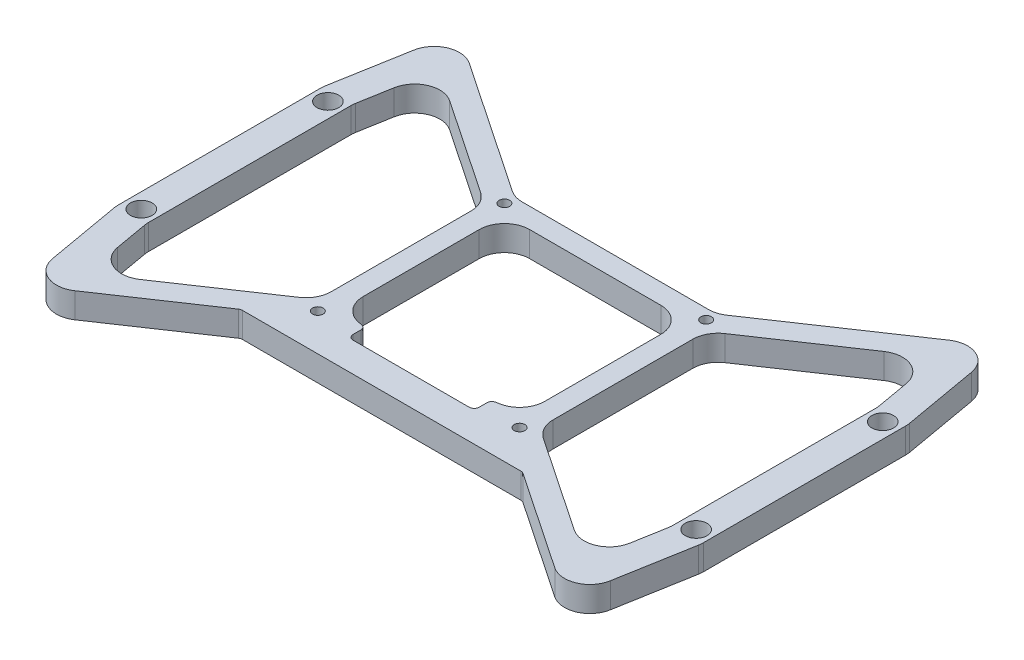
ISO-10303-21;
HEADER;
FILE_DESCRIPTION(('STEP AP214'),'2;1');
FILE_NAME('part.step','',(''),(''),'','','');
FILE_SCHEMA(('AUTOMOTIVE_DESIGN { 1 0 10303 214 1 1 1 1 }'));
ENDSEC;
DATA;
#1=APPLICATION_CONTEXT('core data for automotive mechanical design processes');
#2=APPLICATION_PROTOCOL_DEFINITION('international standard','automotive_design',2000,#1);
#3=PRODUCT_CONTEXT('',#1,'mechanical');
#4=PRODUCT('Part','Part','',(#3));
#5=PRODUCT_RELATED_PRODUCT_CATEGORY('part','',(#4));
#6=PRODUCT_DEFINITION_FORMATION('','',#4);
#7=PRODUCT_DEFINITION_CONTEXT('part definition',#1,'design');
#8=PRODUCT_DEFINITION('design','',#6,#7);
#9=PRODUCT_DEFINITION_SHAPE('','',#8);
#10=(LENGTH_UNIT() NAMED_UNIT(*) SI_UNIT(.MILLI.,.METRE.));
#11=(NAMED_UNIT(*) PLANE_ANGLE_UNIT() SI_UNIT($,.RADIAN.));
#12=(NAMED_UNIT(*) SI_UNIT($,.STERADIAN.) SOLID_ANGLE_UNIT());
#13=UNCERTAINTY_MEASURE_WITH_UNIT(LENGTH_MEASURE(1.E-05),#10,'distance_accuracy_value','');
#14=(GEOMETRIC_REPRESENTATION_CONTEXT(3) GLOBAL_UNCERTAINTY_ASSIGNED_CONTEXT((#13)) GLOBAL_UNIT_ASSIGNED_CONTEXT((#10,
#11,#12)) REPRESENTATION_CONTEXT('',''));
#15=CARTESIAN_POINT('',(0.,0.,0.));
#16=DIRECTION('',(0.,0.,1.));
#17=DIRECTION('',(1.,0.,0.));
#18=AXIS2_PLACEMENT_3D('',#15,#16,#17);
#19=CARTESIAN_POINT('',(-58.,5.,0.));
#20=DIRECTION('',(1.,0.,0.));
#21=DIRECTION('',(0.,0.,-1.));
#22=AXIS2_PLACEMENT_3D('',#19,#20,#21);
#23=PLANE('',#22);
#24=DIRECTION('',(0.,0.,1.));
#25=VECTOR('',#24,1.);
#26=CARTESIAN_POINT('',(-58.,5.,0.));
#27=LINE('',#26,#25);
#28=CARTESIAN_POINT('',(-58.,5.,-20.0625566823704));
#29=VERTEX_POINT('',#28);
#30=CARTESIAN_POINT('',(-58.,5.,20.0625566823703));
#31=VERTEX_POINT('',#30);
#32=EDGE_CURVE('E1001',#29,#31,#27,.T.);
#33=ORIENTED_EDGE('',*,*,#32,.F.);
#34=DIRECTION('',(0.,-1.,0.));
#35=VECTOR('',#34,1.);
#36=CARTESIAN_POINT('',(-58.,0.,-20.0625566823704));
#37=LINE('',#36,#35);
#38=CARTESIAN_POINT('',(-58.,0.,-20.0625566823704));
#39=VERTEX_POINT('',#38);
#40=EDGE_CURVE('E681',#29,#39,#37,.T.);
#41=ORIENTED_EDGE('',*,*,#40,.T.);
#42=DIRECTION('',(0.,0.,1.));
#43=VECTOR('',#42,1.);
#44=CARTESIAN_POINT('',(-58.,0.,0.));
#45=LINE('',#44,#43);
#46=CARTESIAN_POINT('',(-58.,0.,20.0625566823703));
#47=VERTEX_POINT('',#46);
#48=EDGE_CURVE('E1118',#39,#47,#45,.T.);
#49=ORIENTED_EDGE('',*,*,#48,.T.);
#50=DIRECTION('',(0.,-1.,0.));
#51=VECTOR('',#50,1.);
#52=CARTESIAN_POINT('',(-58.,5.,20.0625566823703));
#53=LINE('',#52,#51);
#54=EDGE_CURVE('E678',#47,#31,#53,.F.);
#55=ORIENTED_EDGE('',*,*,#54,.T.);
#56=EDGE_LOOP('',(#33,#41,#49,#55));
#57=FACE_BOUND('',#56,.T.);
#58=ADVANCED_FACE('F44',(#57),#23,.F.);
#59=CARTESIAN_POINT('',(-59.7567924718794,5.,10.5367347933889));
#60=DIRECTION('',(0.984807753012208,0.,-0.173648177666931));
#61=DIRECTION('',(-0.173648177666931,0.,-0.984807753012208));
#62=AXIS2_PLACEMENT_3D('',#59,#60,#61);
#63=PLANE('',#62);
#64=DIRECTION('',(0.173648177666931,0.,0.984807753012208));
#65=VECTOR('',#64,1.);
#66=CARTESIAN_POINT('',(-59.7567924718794,5.,10.5367347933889));
#67=LINE('',#66,#65);
#68=CARTESIAN_POINT('',(-57.924038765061,5.,20.930797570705));
#69=VERTEX_POINT('',#68);
#70=CARTESIAN_POINT('',(-55.2995635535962,5.,35.8149361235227));
#71=VERTEX_POINT('',#70);
#72=EDGE_CURVE('E1005',#69,#71,#67,.T.);
#73=ORIENTED_EDGE('',*,*,#72,.F.);
#74=DIRECTION('',(0.,-1.,0.));
#75=VECTOR('',#74,1.);
#76=CARTESIAN_POINT('',(-57.924038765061,5.,20.930797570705));
#77=LINE('',#76,#75);
#78=CARTESIAN_POINT('',(-57.924038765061,0.,20.930797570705));
#79=VERTEX_POINT('',#78);
#80=EDGE_CURVE('E688',#69,#79,#77,.T.);
#81=ORIENTED_EDGE('',*,*,#80,.T.);
#82=DIRECTION('',(0.173648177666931,0.,0.984807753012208));
#83=VECTOR('',#82,1.);
#84=CARTESIAN_POINT('',(-59.7567924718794,0.,10.5367347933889));
#85=LINE('',#84,#83);
#86=CARTESIAN_POINT('',(-55.2995635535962,0.,35.8149361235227));
#87=VERTEX_POINT('',#86);
#88=EDGE_CURVE('E1122',#79,#87,#85,.T.);
#89=ORIENTED_EDGE('',*,*,#88,.T.);
#90=DIRECTION('',(0.,-1.,0.));
#91=VECTOR('',#90,1.);
#92=CARTESIAN_POINT('',(-55.2995635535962,5.,35.8149361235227));
#93=LINE('',#92,#91);
#94=EDGE_CURVE('E685',#87,#71,#93,.F.);
#95=ORIENTED_EDGE('',*,*,#94,.T.);
#96=EDGE_LOOP('',(#73,#81,#89,#95));
#97=FACE_BOUND('',#96,.T.);
#98=ADVANCED_FACE('F1184',(#97),#63,.F.);
#99=CARTESIAN_POINT('',(3.25261362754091,5.,4.82499013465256));
#100=DIRECTION('',(-0.558970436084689,0.,-0.829187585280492));
#101=DIRECTION('',(-0.829187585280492,0.,0.558970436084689));
#102=AXIS2_PLACEMENT_3D('',#99,#100,#101);
#103=PLANE('',#102);
#104=DIRECTION('',(0.829187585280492,0.,-0.558970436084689));
#105=VECTOR('',#104,1.);
#106=CARTESIAN_POINT('',(3.25261362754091,0.,4.82499013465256));
#107=LINE('',#106,#105);
#108=CARTESIAN_POINT('',(-47.5806726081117,0.,39.0926331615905));
#109=VERTEX_POINT('',#108);
#110=CARTESIAN_POINT('',(-28.1870640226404,0.,26.0190487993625));
#111=VERTEX_POINT('',#110);
#112=EDGE_CURVE('E1126',#109,#111,#107,.T.);
#113=ORIENTED_EDGE('',*,*,#112,.T.);
#114=DIRECTION('',(0.,1.,0.));
#115=VECTOR('',#114,1.);
#116=CARTESIAN_POINT('',(-28.1870640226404,5.,26.0190487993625));
#117=LINE('',#116,#115);
#118=CARTESIAN_POINT('',(-28.1870640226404,5.,26.0190487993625));
#119=VERTEX_POINT('',#118);
#120=EDGE_CURVE('E808',#111,#119,#117,.T.);
#121=ORIENTED_EDGE('',*,*,#120,.T.);
#122=DIRECTION('',(0.829187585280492,0.,-0.558970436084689));
#123=VECTOR('',#122,1.);
#124=CARTESIAN_POINT('',(3.25261362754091,5.,4.82499013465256));
#125=LINE('',#124,#123);
#126=CARTESIAN_POINT('',(-47.5806726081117,5.,39.0926331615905));
#127=VERTEX_POINT('',#126);
#128=EDGE_CURVE('E1009',#127,#119,#125,.T.);
#129=ORIENTED_EDGE('',*,*,#128,.F.);
#130=DIRECTION('',(0.,-1.,0.));
#131=VECTOR('',#130,1.);
#132=CARTESIAN_POINT('',(-47.5806726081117,5.,39.0926331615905));
#133=LINE('',#132,#131);
#134=EDGE_CURVE('E574',#127,#109,#133,.T.);
#135=ORIENTED_EDGE('',*,*,#134,.T.);
#136=EDGE_LOOP('',(#113,#121,#129,#135));
#137=FACE_BOUND('',#136,.T.);
#138=ADVANCED_FACE('F1192',(#137),#103,.F.);
#139=CARTESIAN_POINT('',(-3.2526136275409,5.,4.82499013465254));
#140=DIRECTION('',(-0.558970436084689,0.,0.829187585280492));
#141=DIRECTION('',(0.829187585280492,0.,0.558970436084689));
#142=AXIS2_PLACEMENT_3D('',#139,#140,#141);
#143=PLANE('',#142);
#144=DIRECTION('',(-0.829187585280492,0.,-0.558970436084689));
#145=VECTOR('',#144,1.);
#146=CARTESIAN_POINT('',(-3.2526136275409,5.,4.82499013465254));
#147=LINE('',#146,#145);
#148=CARTESIAN_POINT('',(47.5806726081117,5.,39.0926331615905));
#149=VERTEX_POINT('',#148);
#150=CARTESIAN_POINT('',(28.1870640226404,5.,26.0190487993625));
#151=VERTEX_POINT('',#150);
#152=EDGE_CURVE('E1013',#149,#151,#147,.T.);
#153=ORIENTED_EDGE('',*,*,#152,.T.);
#154=DIRECTION('',(0.,1.,0.));
#155=VECTOR('',#154,1.);
#156=CARTESIAN_POINT('',(28.1870640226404,0.,26.0190487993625));
#157=LINE('',#156,#155);
#158=CARTESIAN_POINT('',(28.1870640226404,0.,26.0190487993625));
#159=VERTEX_POINT('',#158);
#160=EDGE_CURVE('E805',#151,#159,#157,.F.);
#161=ORIENTED_EDGE('',*,*,#160,.T.);
#162=DIRECTION('',(-0.829187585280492,0.,-0.558970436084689));
#163=VECTOR('',#162,1.);
#164=CARTESIAN_POINT('',(-3.2526136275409,0.,4.82499013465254));
#165=LINE('',#164,#163);
#166=CARTESIAN_POINT('',(47.5806726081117,0.,39.0926331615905));
#167=VERTEX_POINT('',#166);
#168=EDGE_CURVE('E1130',#167,#159,#165,.T.);
#169=ORIENTED_EDGE('',*,*,#168,.F.);
#170=DIRECTION('',(0.,-1.,0.));
#171=VECTOR('',#170,1.);
#172=CARTESIAN_POINT('',(47.5806726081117,5.,39.0926331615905));
#173=LINE('',#172,#171);
#174=EDGE_CURVE('E578',#167,#149,#173,.F.);
#175=ORIENTED_EDGE('',*,*,#174,.T.);
#176=EDGE_LOOP('',(#153,#161,#169,#175));
#177=FACE_BOUND('',#176,.T.);
#178=ADVANCED_FACE('F1901',(#177),#143,.T.);
#179=CARTESIAN_POINT('',(59.7567924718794,5.,10.5367347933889));
#180=DIRECTION('',(0.984807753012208,0.,0.173648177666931));
#181=DIRECTION('',(0.173648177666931,0.,-0.984807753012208));
#182=AXIS2_PLACEMENT_3D('',#179,#180,#181);
#183=PLANE('',#182);
#184=DIRECTION('',(-0.173648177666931,0.,0.984807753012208));
#185=VECTOR('',#184,1.);
#186=CARTESIAN_POINT('',(59.7567924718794,5.,10.5367347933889));
#187=LINE('',#186,#185);
#188=CARTESIAN_POINT('',(57.924038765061,5.,20.930797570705));
#189=VERTEX_POINT('',#188);
#190=CARTESIAN_POINT('',(55.2995635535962,5.,35.8149361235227));
#191=VERTEX_POINT('',#190);
#192=EDGE_CURVE('E1017',#189,#191,#187,.T.);
#193=ORIENTED_EDGE('',*,*,#192,.T.);
#194=DIRECTION('',(0.,-1.,0.));
#195=VECTOR('',#194,1.);
#196=CARTESIAN_POINT('',(55.2995635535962,5.,35.8149361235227));
#197=LINE('',#196,#195);
#198=CARTESIAN_POINT('',(55.2995635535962,0.,35.8149361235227));
#199=VERTEX_POINT('',#198);
#200=EDGE_CURVE('E584',#191,#199,#197,.T.);
#201=ORIENTED_EDGE('',*,*,#200,.T.);
#202=DIRECTION('',(-0.173648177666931,0.,0.984807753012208));
#203=VECTOR('',#202,1.);
#204=CARTESIAN_POINT('',(59.7567924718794,0.,10.5367347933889));
#205=LINE('',#204,#203);
#206=CARTESIAN_POINT('',(57.924038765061,0.,20.930797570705));
#207=VERTEX_POINT('',#206);
#208=EDGE_CURVE('E1134',#207,#199,#205,.T.);
#209=ORIENTED_EDGE('',*,*,#208,.F.);
#210=DIRECTION('',(0.,-1.,0.));
#211=VECTOR('',#210,1.);
#212=CARTESIAN_POINT('',(57.924038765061,5.,20.930797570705));
#213=LINE('',#212,#211);
#214=EDGE_CURVE('E581',#207,#189,#213,.F.);
#215=ORIENTED_EDGE('',*,*,#214,.T.);
#216=EDGE_LOOP('',(#193,#201,#209,#215));
#217=FACE_BOUND('',#216,.T.);
#218=ADVANCED_FACE('F1891',(#217),#183,.T.);
#219=CARTESIAN_POINT('',(58.,5.,0.));
#220=DIRECTION('',(1.,0.,0.));
#221=DIRECTION('',(0.,0.,-1.));
#222=AXIS2_PLACEMENT_3D('',#219,#220,#221);
#223=PLANE('',#222);
#224=DIRECTION('',(0.,0.,1.));
#225=VECTOR('',#224,1.);
#226=CARTESIAN_POINT('',(58.,5.,0.));
#227=LINE('',#226,#225);
#228=CARTESIAN_POINT('',(58.,5.,-20.0625566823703));
#229=VERTEX_POINT('',#228);
#230=CARTESIAN_POINT('',(58.,5.,20.0625566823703));
#231=VERTEX_POINT('',#230);
#232=EDGE_CURVE('E1021',#229,#231,#227,.T.);
#233=ORIENTED_EDGE('',*,*,#232,.T.);
#234=DIRECTION('',(0.,-1.,0.));
#235=VECTOR('',#234,1.);
#236=CARTESIAN_POINT('',(58.,5.,20.0625566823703));
#237=LINE('',#236,#235);
#238=CARTESIAN_POINT('',(58.,0.,20.0625566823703));
#239=VERTEX_POINT('',#238);
#240=EDGE_CURVE('E639',#231,#239,#237,.T.);
#241=ORIENTED_EDGE('',*,*,#240,.T.);
#242=DIRECTION('',(0.,0.,1.));
#243=VECTOR('',#242,1.);
#244=CARTESIAN_POINT('',(58.,0.,0.));
#245=LINE('',#244,#243);
#246=CARTESIAN_POINT('',(58.,0.,-20.0625566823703));
#247=VERTEX_POINT('',#246);
#248=EDGE_CURVE('E1138',#247,#239,#245,.T.);
#249=ORIENTED_EDGE('',*,*,#248,.F.);
#250=DIRECTION('',(0.,-1.,0.));
#251=VECTOR('',#250,1.);
#252=CARTESIAN_POINT('',(58.,5.,-20.0625566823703));
#253=LINE('',#252,#251);
#254=EDGE_CURVE('E636',#247,#229,#253,.F.);
#255=ORIENTED_EDGE('',*,*,#254,.T.);
#256=EDGE_LOOP('',(#233,#241,#249,#255));
#257=FACE_BOUND('',#256,.T.);
#258=ADVANCED_FACE('F1881',(#257),#223,.T.);
#259=CARTESIAN_POINT('',(59.7567924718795,5.,-10.5367347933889));
#260=DIRECTION('',(-0.984807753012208,0.,0.173648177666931));
#261=DIRECTION('',(0.173648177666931,0.,0.984807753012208));
#262=AXIS2_PLACEMENT_3D('',#259,#260,#261);
#263=PLANE('',#262);
#264=DIRECTION('',(-0.173648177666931,0.,-0.984807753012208));
#265=VECTOR('',#264,1.);
#266=CARTESIAN_POINT('',(59.7567924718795,5.,-10.5367347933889));
#267=LINE('',#266,#265);
#268=CARTESIAN_POINT('',(57.924038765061,5.,-20.930797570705));
#269=VERTEX_POINT('',#268);
#270=CARTESIAN_POINT('',(55.2995635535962,5.,-35.8149361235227));
#271=VERTEX_POINT('',#270);
#272=EDGE_CURVE('E1025',#269,#271,#267,.T.);
#273=ORIENTED_EDGE('',*,*,#272,.F.);
#274=DIRECTION('',(0.,-1.,0.));
#275=VECTOR('',#274,1.);
#276=CARTESIAN_POINT('',(57.924038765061,0.,-20.930797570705));
#277=LINE('',#276,#275);
#278=CARTESIAN_POINT('',(57.924038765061,0.,-20.930797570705));
#279=VERTEX_POINT('',#278);
#280=EDGE_CURVE('E646',#269,#279,#277,.T.);
#281=ORIENTED_EDGE('',*,*,#280,.T.);
#282=DIRECTION('',(-0.173648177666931,0.,-0.984807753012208));
#283=VECTOR('',#282,1.);
#284=CARTESIAN_POINT('',(59.7567924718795,0.,-10.5367347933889));
#285=LINE('',#284,#283);
#286=CARTESIAN_POINT('',(55.2995635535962,0.,-35.8149361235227));
#287=VERTEX_POINT('',#286);
#288=EDGE_CURVE('E1142',#279,#287,#285,.T.);
#289=ORIENTED_EDGE('',*,*,#288,.T.);
#290=DIRECTION('',(0.,-1.,0.));
#291=VECTOR('',#290,1.);
#292=CARTESIAN_POINT('',(55.2995635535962,5.,-35.8149361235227));
#293=LINE('',#292,#291);
#294=EDGE_CURVE('E643',#287,#271,#293,.F.);
#295=ORIENTED_EDGE('',*,*,#294,.T.);
#296=EDGE_LOOP('',(#273,#281,#289,#295));
#297=FACE_BOUND('',#296,.T.);
#298=ADVANCED_FACE('F1871',(#297),#263,.F.);
#299=CARTESIAN_POINT('',(-3.25261362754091,5.,-4.82499013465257));
#300=DIRECTION('',(0.558970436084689,0.,0.829187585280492));
#301=DIRECTION('',(0.829187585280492,0.,-0.558970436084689));
#302=AXIS2_PLACEMENT_3D('',#299,#300,#301);
#303=PLANE('',#302);
#304=DIRECTION('',(-0.829187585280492,0.,0.558970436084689));
#305=VECTOR('',#304,1.);
#306=CARTESIAN_POINT('',(-3.25261362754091,5.,-4.82499013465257));
#307=LINE('',#306,#305);
#308=CARTESIAN_POINT('',(47.5806726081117,5.,-39.0926331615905));
#309=VERTEX_POINT('',#308);
#310=CARTESIAN_POINT('',(21.2669322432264,5.,-21.3540620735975));
#311=VERTEX_POINT('',#310);
#312=EDGE_CURVE('E1029',#309,#311,#307,.T.);
#313=ORIENTED_EDGE('',*,*,#312,.F.);
#314=DIRECTION('',(0.,-1.,0.));
#315=VECTOR('',#314,1.);
#316=CARTESIAN_POINT('',(47.5806726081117,5.,-39.0926331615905));
#317=LINE('',#316,#315);
#318=CARTESIAN_POINT('',(47.5806726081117,0.,-39.0926331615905));
#319=VERTEX_POINT('',#318);
#320=EDGE_CURVE('E653',#309,#319,#317,.T.);
#321=ORIENTED_EDGE('',*,*,#320,.T.);
#322=DIRECTION('',(-0.829187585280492,0.,0.558970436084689));
#323=VECTOR('',#322,1.);
#324=CARTESIAN_POINT('',(-3.25261362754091,0.,-4.82499013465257));
#325=LINE('',#324,#323);
#326=CARTESIAN_POINT('',(21.2669322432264,0.,-21.3540620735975));
#327=VERTEX_POINT('',#326);
#328=EDGE_CURVE('E1146',#319,#327,#325,.T.);
#329=ORIENTED_EDGE('',*,*,#328,.T.);
#330=DIRECTION('',(0.,-1.,0.));
#331=VECTOR('',#330,1.);
#332=CARTESIAN_POINT('',(21.2669322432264,5.,-21.3540620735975));
#333=LINE('',#332,#331);
#334=EDGE_CURVE('E650',#327,#311,#333,.F.);
#335=ORIENTED_EDGE('',*,*,#334,.T.);
#336=EDGE_LOOP('',(#313,#321,#329,#335));
#337=FACE_BOUND('',#336,.T.);
#338=ADVANCED_FACE('F1861',(#337),#303,.F.);
#339=CARTESIAN_POINT('',(0.,5.,-20.5));
#340=DIRECTION('',(0.,0.,-1.));
#341=DIRECTION('',(-1.,0.,0.));
#342=AXIS2_PLACEMENT_3D('',#339,#340,#341);
#343=PLANE('',#342);
#344=DIRECTION('',(1.,0.,0.));
#345=VECTOR('',#344,1.);
#346=CARTESIAN_POINT('',(0.,5.,-20.5));
#347=LINE('',#346,#345);
#348=CARTESIAN_POINT('',(-18.4720800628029,5.,-20.5));
#349=VERTEX_POINT('',#348);
#350=CARTESIAN_POINT('',(18.4720800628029,5.,-20.5));
#351=VERTEX_POINT('',#350);
#352=EDGE_CURVE('E1033',#349,#351,#347,.T.);
#353=ORIENTED_EDGE('',*,*,#352,.T.);
#354=DIRECTION('',(0.,-1.,0.));
#355=VECTOR('',#354,1.);
#356=CARTESIAN_POINT('',(18.4720800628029,5.,-20.5));
#357=LINE('',#356,#355);
#358=CARTESIAN_POINT('',(18.4720800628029,0.,-20.5));
#359=VERTEX_POINT('',#358);
#360=EDGE_CURVE('E660',#351,#359,#357,.T.);
#361=ORIENTED_EDGE('',*,*,#360,.T.);
#362=DIRECTION('',(1.,0.,0.));
#363=VECTOR('',#362,1.);
#364=CARTESIAN_POINT('',(0.,0.,-20.5));
#365=LINE('',#364,#363);
#366=CARTESIAN_POINT('',(-18.4720800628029,0.,-20.5));
#367=VERTEX_POINT('',#366);
#368=EDGE_CURVE('E1150',#367,#359,#365,.T.);
#369=ORIENTED_EDGE('',*,*,#368,.F.);
#370=DIRECTION('',(0.,-1.,0.));
#371=VECTOR('',#370,1.);
#372=CARTESIAN_POINT('',(-18.4720800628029,5.,-20.5));
#373=LINE('',#372,#371);
#374=EDGE_CURVE('E657',#367,#349,#373,.F.);
#375=ORIENTED_EDGE('',*,*,#374,.T.);
#376=EDGE_LOOP('',(#353,#361,#369,#375));
#377=FACE_BOUND('',#376,.T.);
#378=ADVANCED_FACE('F1851',(#377),#343,.T.);
#379=CARTESIAN_POINT('',(3.25261362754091,5.,-4.82499013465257));
#380=DIRECTION('',(0.558970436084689,0.,-0.829187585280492));
#381=DIRECTION('',(-0.829187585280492,0.,-0.558970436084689));
#382=AXIS2_PLACEMENT_3D('',#379,#380,#381);
#383=PLANE('',#382);
#384=DIRECTION('',(0.829187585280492,0.,0.558970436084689));
#385=VECTOR('',#384,1.);
#386=CARTESIAN_POINT('',(3.25261362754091,5.,-4.82499013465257));
#387=LINE('',#386,#385);
#388=CARTESIAN_POINT('',(-47.5806726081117,5.,-39.0926331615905));
#389=VERTEX_POINT('',#388);
#390=CARTESIAN_POINT('',(-21.2669322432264,5.,-21.3540620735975));
#391=VERTEX_POINT('',#390);
#392=EDGE_CURVE('E471',#389,#391,#387,.T.);
#393=ORIENTED_EDGE('',*,*,#392,.T.);
#394=DIRECTION('',(0.,-1.,0.));
#395=VECTOR('',#394,1.);
#396=CARTESIAN_POINT('',(-21.2669322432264,0.,-21.3540620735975));
#397=LINE('',#396,#395);
#398=CARTESIAN_POINT('',(-21.2669322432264,0.,-21.3540620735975));
#399=VERTEX_POINT('',#398);
#400=EDGE_CURVE('E667',#391,#399,#397,.T.);
#401=ORIENTED_EDGE('',*,*,#400,.T.);
#402=DIRECTION('',(0.829187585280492,0.,0.558970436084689));
#403=VECTOR('',#402,1.);
#404=CARTESIAN_POINT('',(3.25261362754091,0.,-4.82499013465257));
#405=LINE('',#404,#403);
#406=CARTESIAN_POINT('',(-47.5806726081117,0.,-39.0926331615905));
#407=VERTEX_POINT('',#406);
#408=EDGE_CURVE('E1153',#407,#399,#405,.T.);
#409=ORIENTED_EDGE('',*,*,#408,.F.);
#410=DIRECTION('',(0.,-1.,0.));
#411=VECTOR('',#410,1.);
#412=CARTESIAN_POINT('',(-47.5806726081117,5.,-39.0926331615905));
#413=LINE('',#412,#411);
#414=EDGE_CURVE('E664',#407,#389,#413,.F.);
#415=ORIENTED_EDGE('',*,*,#414,.T.);
#416=EDGE_LOOP('',(#393,#401,#409,#415));
#417=FACE_BOUND('',#416,.T.);
#418=ADVANCED_FACE('F1326',(#417),#383,.T.);
#419=CARTESIAN_POINT('',(22.,5.,0.));
#420=DIRECTION('',(1.,0.,0.));
#421=DIRECTION('',(0.,0.,-1.));
#422=AXIS2_PLACEMENT_3D('',#419,#420,#421);
#423=PLANE('',#422);
#424=DIRECTION('',(0.,0.,1.));
#425=VECTOR('',#424,1.);
#426=CARTESIAN_POINT('',(22.,5.,0.));
#427=LINE('',#426,#425);
#428=CARTESIAN_POINT('',(22.,5.,-13.8405923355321));
#429=VERTEX_POINT('',#428);
#430=CARTESIAN_POINT('',(22.,5.,13.8405923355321));
#431=VERTEX_POINT('',#430);
#432=EDGE_CURVE('E946',#429,#431,#427,.T.);
#433=ORIENTED_EDGE('',*,*,#432,.T.);
#434=DIRECTION('',(0.,-1.,0.));
#435=VECTOR('',#434,1.);
#436=CARTESIAN_POINT('',(22.,0.,13.8405923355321));
#437=LINE('',#436,#435);
#438=CARTESIAN_POINT('',(22.,0.,13.8405923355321));
#439=VERTEX_POINT('',#438);
#440=EDGE_CURVE('E514',#431,#439,#437,.T.);
#441=ORIENTED_EDGE('',*,*,#440,.T.);
#442=DIRECTION('',(0.,0.,1.));
#443=VECTOR('',#442,1.);
#444=CARTESIAN_POINT('',(22.,0.,0.));
#445=LINE('',#444,#443);
#446=CARTESIAN_POINT('',(22.,0.,-13.8405923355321));
#447=VERTEX_POINT('',#446);
#448=EDGE_CURVE('E1063',#447,#439,#445,.T.);
#449=ORIENTED_EDGE('',*,*,#448,.F.);
#450=DIRECTION('',(0.,-1.,0.));
#451=VECTOR('',#450,1.);
#452=CARTESIAN_POINT('',(22.,5.,-13.8405923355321));
#453=LINE('',#452,#451);
#454=EDGE_CURVE('E511',#447,#429,#453,.F.);
#455=ORIENTED_EDGE('',*,*,#454,.T.);
#456=EDGE_LOOP('',(#433,#441,#449,#455));
#457=FACE_BOUND('',#456,.T.);
#458=ADVANCED_FACE('F1322',(#457),#423,.T.);
#459=CARTESIAN_POINT('',(-0.773752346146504,5.,-1.1477992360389));
#460=DIRECTION('',(-0.558970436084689,0.,-0.829187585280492));
#461=DIRECTION('',(-0.829187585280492,0.,0.558970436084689));
#462=AXIS2_PLACEMENT_3D('',#459,#460,#461);
#463=PLANE('',#462);
#464=DIRECTION('',(0.829187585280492,0.,-0.558970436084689));
#465=VECTOR('',#464,1.);
#466=CARTESIAN_POINT('',(-0.773752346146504,5.,-1.1477992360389));
#467=LINE('',#466,#465);
#468=CARTESIAN_POINT('',(24.2051478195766,5.,-17.9865302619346));
#469=VERTEX_POINT('',#468);
#470=CARTESIAN_POINT('',(43.0609489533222,5.,-30.6975688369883));
#471=VERTEX_POINT('',#470);
#472=EDGE_CURVE('E950',#469,#471,#467,.T.);
#473=ORIENTED_EDGE('',*,*,#472,.F.);
#474=DIRECTION('',(0.,-1.,0.));
#475=VECTOR('',#474,1.);
#476=CARTESIAN_POINT('',(24.2051478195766,5.,-17.9865302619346));
#477=LINE('',#476,#475);
#478=CARTESIAN_POINT('',(24.2051478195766,0.,-17.9865302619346));
#479=VERTEX_POINT('',#478);
#480=EDGE_CURVE('E528',#469,#479,#477,.T.);
#481=ORIENTED_EDGE('',*,*,#480,.T.);
#482=DIRECTION('',(0.829187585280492,0.,-0.558970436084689));
#483=VECTOR('',#482,1.);
#484=CARTESIAN_POINT('',(-0.773752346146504,0.,-1.1477992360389));
#485=LINE('',#484,#483);
#486=CARTESIAN_POINT('',(43.0609489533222,0.,-30.6975688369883));
#487=VERTEX_POINT('',#486);
#488=EDGE_CURVE('E1067',#479,#487,#485,.T.);
#489=ORIENTED_EDGE('',*,*,#488,.T.);
#490=DIRECTION('',(0.,-1.,0.));
#491=VECTOR('',#490,1.);
#492=CARTESIAN_POINT('',(43.0609489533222,5.,-30.6975688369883));
#493=LINE('',#492,#491);
#494=EDGE_CURVE('E525',#487,#471,#493,.F.);
#495=ORIENTED_EDGE('',*,*,#494,.T.);
#496=EDGE_LOOP('',(#473,#481,#489,#495));
#497=FACE_BOUND('',#496,.T.);
#498=ADVANCED_FACE('F1318',(#497),#463,.F.);
#499=CARTESIAN_POINT('',(53.9377146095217,5.,-9.51067436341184));
#500=DIRECTION('',(0.984807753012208,0.,-0.173648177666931));
#501=DIRECTION('',(-0.173648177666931,0.,-0.984807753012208));
#502=AXIS2_PLACEMENT_3D('',#499,#500,#501);
#503=PLANE('',#502);
#504=DIRECTION('',(0.173648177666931,0.,0.984807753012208));
#505=VECTOR('',#504,1.);
#506=CARTESIAN_POINT('',(53.9377146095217,5.,-9.51067436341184));
#507=LINE('',#506,#505);
#508=CARTESIAN_POINT('',(50.7798398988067,5.,-27.4198717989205));
#509=VERTEX_POINT('',#508);
#510=CARTESIAN_POINT('',(51.924038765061,5.,-20.930797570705));
#511=VERTEX_POINT('',#510);
#512=EDGE_CURVE('E954',#509,#511,#507,.T.);
#513=ORIENTED_EDGE('',*,*,#512,.F.);
#514=DIRECTION('',(0.,-1.,0.));
#515=VECTOR('',#514,1.);
#516=CARTESIAN_POINT('',(50.7798398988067,0.,-27.4198717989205));
#517=LINE('',#516,#515);
#518=CARTESIAN_POINT('',(50.7798398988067,0.,-27.4198717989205));
#519=VERTEX_POINT('',#518);
#520=EDGE_CURVE('E535',#509,#519,#517,.T.);
#521=ORIENTED_EDGE('',*,*,#520,.T.);
#522=DIRECTION('',(0.173648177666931,0.,0.984807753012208));
#523=VECTOR('',#522,1.);
#524=CARTESIAN_POINT('',(53.9377146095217,0.,-9.51067436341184));
#525=LINE('',#524,#523);
#526=CARTESIAN_POINT('',(51.924038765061,0.,-20.930797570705));
#527=VERTEX_POINT('',#526);
#528=EDGE_CURVE('E1071',#519,#527,#525,.T.);
#529=ORIENTED_EDGE('',*,*,#528,.T.);
#530=DIRECTION('',(0.,-1.,0.));
#531=VECTOR('',#530,1.);
#532=CARTESIAN_POINT('',(51.924038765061,5.,-20.930797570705));
#533=LINE('',#532,#531);
#534=EDGE_CURVE('E532',#527,#511,#533,.F.);
#535=ORIENTED_EDGE('',*,*,#534,.T.);
#536=EDGE_LOOP('',(#513,#521,#529,#535));
#537=FACE_BOUND('',#536,.T.);
#538=ADVANCED_FACE('F1314',(#537),#503,.F.);
#539=CARTESIAN_POINT('',(52.,5.,0.));
#540=DIRECTION('',(1.,0.,0.));
#541=DIRECTION('',(0.,0.,-1.));
#542=AXIS2_PLACEMENT_3D('',#539,#540,#541);
#543=PLANE('',#542);
#544=DIRECTION('',(0.,0.,1.));
#545=VECTOR('',#544,1.);
#546=CARTESIAN_POINT('',(52.,5.,0.));
#547=LINE('',#546,#545);
#548=CARTESIAN_POINT('',(52.,5.,-20.0625566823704));
#549=VERTEX_POINT('',#548);
#550=CARTESIAN_POINT('',(52.,5.,20.0625566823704));
#551=VERTEX_POINT('',#550);
#552=EDGE_CURVE('E958',#549,#551,#547,.T.);
#553=ORIENTED_EDGE('',*,*,#552,.F.);
#554=DIRECTION('',(0.,-1.,0.));
#555=VECTOR('',#554,1.);
#556=CARTESIAN_POINT('',(52.,0.,-20.0625566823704));
#557=LINE('',#556,#555);
#558=CARTESIAN_POINT('',(52.,0.,-20.0625566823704));
#559=VERTEX_POINT('',#558);
#560=EDGE_CURVE('E542',#549,#559,#557,.T.);
#561=ORIENTED_EDGE('',*,*,#560,.T.);
#562=DIRECTION('',(0.,0.,1.));
#563=VECTOR('',#562,1.);
#564=CARTESIAN_POINT('',(52.,0.,0.));
#565=LINE('',#564,#563);
#566=CARTESIAN_POINT('',(52.,0.,20.0625566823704));
#567=VERTEX_POINT('',#566);
#568=EDGE_CURVE('E1075',#559,#567,#565,.T.);
#569=ORIENTED_EDGE('',*,*,#568,.T.);
#570=DIRECTION('',(0.,-1.,0.));
#571=VECTOR('',#570,1.);
#572=CARTESIAN_POINT('',(52.,5.,20.0625566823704));
#573=LINE('',#572,#571);
#574=EDGE_CURVE('E539',#567,#551,#573,.F.);
#575=ORIENTED_EDGE('',*,*,#574,.T.);
#576=EDGE_LOOP('',(#553,#561,#569,#575));
#577=FACE_BOUND('',#576,.T.);
#578=ADVANCED_FACE('F1310',(#577),#543,.F.);
#579=CARTESIAN_POINT('',(53.9377146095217,5.,9.51067436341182));
#580=DIRECTION('',(-0.984807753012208,0.,-0.17364817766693));
#581=DIRECTION('',(-0.17364817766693,0.,0.984807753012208));
#582=AXIS2_PLACEMENT_3D('',#579,#580,#581);
#583=PLANE('',#582);
#584=DIRECTION('',(0.17364817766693,0.,-0.984807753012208));
#585=VECTOR('',#584,1.);
#586=CARTESIAN_POINT('',(53.9377146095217,5.,9.51067436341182));
#587=LINE('',#586,#585);
#588=CARTESIAN_POINT('',(50.7798398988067,5.,27.4198717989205));
#589=VERTEX_POINT('',#588);
#590=CARTESIAN_POINT('',(51.924038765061,5.,20.930797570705));
#591=VERTEX_POINT('',#590);
#592=EDGE_CURVE('E962',#589,#591,#587,.T.);
#593=ORIENTED_EDGE('',*,*,#592,.T.);
#594=DIRECTION('',(0.,-1.,0.));
#595=VECTOR('',#594,1.);
#596=CARTESIAN_POINT('',(51.924038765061,5.,20.930797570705));
#597=LINE('',#596,#595);
#598=CARTESIAN_POINT('',(51.924038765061,0.,20.930797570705));
#599=VERTEX_POINT('',#598);
#600=EDGE_CURVE('E549',#591,#599,#597,.T.);
#601=ORIENTED_EDGE('',*,*,#600,.T.);
#602=DIRECTION('',(0.17364817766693,0.,-0.984807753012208));
#603=VECTOR('',#602,1.);
#604=CARTESIAN_POINT('',(53.9377146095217,0.,9.51067436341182));
#605=LINE('',#604,#603);
#606=CARTESIAN_POINT('',(50.7798398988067,0.,27.4198717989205));
#607=VERTEX_POINT('',#606);
#608=EDGE_CURVE('E1079',#607,#599,#605,.T.);
#609=ORIENTED_EDGE('',*,*,#608,.F.);
#610=DIRECTION('',(0.,-1.,0.));
#611=VECTOR('',#610,1.);
#612=CARTESIAN_POINT('',(50.7798398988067,5.,27.4198717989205));
#613=LINE('',#612,#611);
#614=EDGE_CURVE('E546',#607,#589,#613,.F.);
#615=ORIENTED_EDGE('',*,*,#614,.T.);
#616=EDGE_LOOP('',(#593,#601,#609,#615));
#617=FACE_BOUND('',#616,.T.);
#618=ADVANCED_FACE('F1306',(#617),#583,.T.);
#619=CARTESIAN_POINT('',(0.773752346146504,5.,-1.1477992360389));
#620=DIRECTION('',(-0.558970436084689,0.,0.829187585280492));
#621=DIRECTION('',(0.829187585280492,0.,0.558970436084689));
#622=AXIS2_PLACEMENT_3D('',#619,#620,#621);
#623=PLANE('',#622);
#624=DIRECTION('',(-0.829187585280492,0.,-0.558970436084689));
#625=VECTOR('',#624,1.);
#626=CARTESIAN_POINT('',(0.773752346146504,5.,-1.1477992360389));
#627=LINE('',#626,#625);
#628=CARTESIAN_POINT('',(-24.2051478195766,5.,-17.9865302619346));
#629=VERTEX_POINT('',#628);
#630=CARTESIAN_POINT('',(-43.0609489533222,5.,-30.6975688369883));
#631=VERTEX_POINT('',#630);
#632=EDGE_CURVE('E924',#629,#631,#627,.T.);
#633=ORIENTED_EDGE('',*,*,#632,.T.);
#634=DIRECTION('',(0.,-1.,0.));
#635=VECTOR('',#634,1.);
#636=CARTESIAN_POINT('',(-43.0609489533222,0.,-30.6975688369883));
#637=LINE('',#636,#635);
#638=CARTESIAN_POINT('',(-43.0609489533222,0.,-30.6975688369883));
#639=VERTEX_POINT('',#638);
#640=EDGE_CURVE('E500',#631,#639,#637,.T.);
#641=ORIENTED_EDGE('',*,*,#640,.T.);
#642=DIRECTION('',(-0.829187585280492,0.,-0.558970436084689));
#643=VECTOR('',#642,1.);
#644=CARTESIAN_POINT('',(0.773752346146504,0.,-1.1477992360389));
#645=LINE('',#644,#643);
#646=CARTESIAN_POINT('',(-24.2051478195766,0.,-17.9865302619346));
#647=VERTEX_POINT('',#646);
#648=EDGE_CURVE('E1047',#647,#639,#645,.T.);
#649=ORIENTED_EDGE('',*,*,#648,.F.);
#650=DIRECTION('',(0.,-1.,0.));
#651=VECTOR('',#650,1.);
#652=CARTESIAN_POINT('',(-24.2051478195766,5.,-17.9865302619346));
#653=LINE('',#652,#651);
#654=EDGE_CURVE('E497',#647,#629,#653,.F.);
#655=ORIENTED_EDGE('',*,*,#654,.T.);
#656=EDGE_LOOP('',(#633,#641,#649,#655));
#657=FACE_BOUND('',#656,.T.);
#658=ADVANCED_FACE('F1309',(#657),#623,.T.);
#659=CARTESIAN_POINT('',(-22.,5.,0.));
#660=DIRECTION('',(1.,0.,0.));
#661=DIRECTION('',(0.,0.,-1.));
#662=AXIS2_PLACEMENT_3D('',#659,#660,#661);
#663=PLANE('',#662);
#664=DIRECTION('',(0.,0.,1.));
#665=VECTOR('',#664,1.);
#666=CARTESIAN_POINT('',(-22.,5.,0.));
#667=LINE('',#666,#665);
#668=CARTESIAN_POINT('',(-22.,5.,-13.8405923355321));
#669=VERTEX_POINT('',#668);
#670=CARTESIAN_POINT('',(-22.,5.,13.8405923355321));
#671=VERTEX_POINT('',#670);
#672=EDGE_CURVE('E928',#669,#671,#667,.T.);
#673=ORIENTED_EDGE('',*,*,#672,.F.);
#674=DIRECTION('',(0.,-1.,0.));
#675=VECTOR('',#674,1.);
#676=CARTESIAN_POINT('',(-22.,5.,-13.8405923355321));
#677=LINE('',#676,#675);
#678=CARTESIAN_POINT('',(-22.,0.,-13.8405923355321));
#679=VERTEX_POINT('',#678);
#680=EDGE_CURVE('E507',#669,#679,#677,.T.);
#681=ORIENTED_EDGE('',*,*,#680,.T.);
#682=DIRECTION('',(0.,0.,1.));
#683=VECTOR('',#682,1.);
#684=CARTESIAN_POINT('',(-22.,0.,0.));
#685=LINE('',#684,#683);
#686=CARTESIAN_POINT('',(-22.,0.,13.8405923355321));
#687=VERTEX_POINT('',#686);
#688=EDGE_CURVE('E1051',#679,#687,#685,.T.);
#689=ORIENTED_EDGE('',*,*,#688,.T.);
#690=DIRECTION('',(0.,-1.,0.));
#691=VECTOR('',#690,1.);
#692=CARTESIAN_POINT('',(-22.,5.,13.8405923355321));
#693=LINE('',#692,#691);
#694=EDGE_CURVE('E504',#687,#671,#693,.F.);
#695=ORIENTED_EDGE('',*,*,#694,.T.);
#696=EDGE_LOOP('',(#673,#681,#689,#695));
#697=FACE_BOUND('',#696,.T.);
#698=ADVANCED_FACE('F1340',(#697),#663,.F.);
#699=CARTESIAN_POINT('',(0.773752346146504,5.,1.1477992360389));
#700=DIRECTION('',(0.558970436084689,0.,0.829187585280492));
#701=DIRECTION('',(0.829187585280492,0.,-0.558970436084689));
#702=AXIS2_PLACEMENT_3D('',#699,#700,#701);
#703=PLANE('',#702);
#704=DIRECTION('',(-0.829187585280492,0.,0.558970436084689));
#705=VECTOR('',#704,1.);
#706=CARTESIAN_POINT('',(0.773752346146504,0.,1.1477992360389));
#707=LINE('',#706,#705);
#708=CARTESIAN_POINT('',(-24.2051478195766,0.,17.9865302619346));
#709=VERTEX_POINT('',#708);
#710=CARTESIAN_POINT('',(-43.0609489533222,0.,30.6975688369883));
#711=VERTEX_POINT('',#710);
#712=EDGE_CURVE('E1055',#709,#711,#707,.T.);
#713=ORIENTED_EDGE('',*,*,#712,.T.);
#714=DIRECTION('',(0.,-1.,0.));
#715=VECTOR('',#714,1.);
#716=CARTESIAN_POINT('',(-43.0609489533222,5.,30.6975688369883));
#717=LINE('',#716,#715);
#718=CARTESIAN_POINT('',(-43.0609489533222,5.,30.6975688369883));
#719=VERTEX_POINT('',#718);
#720=EDGE_CURVE('E487',#711,#719,#717,.F.);
#721=ORIENTED_EDGE('',*,*,#720,.T.);
#722=DIRECTION('',(-0.829187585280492,0.,0.558970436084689));
#723=VECTOR('',#722,1.);
#724=CARTESIAN_POINT('',(0.773752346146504,5.,1.1477992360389));
#725=LINE('',#724,#723);
#726=CARTESIAN_POINT('',(-24.2051478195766,5.,17.9865302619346));
#727=VERTEX_POINT('',#726);
#728=EDGE_CURVE('E932',#727,#719,#725,.T.);
#729=ORIENTED_EDGE('',*,*,#728,.F.);
#730=DIRECTION('',(0.,-1.,0.));
#731=VECTOR('',#730,1.);
#732=CARTESIAN_POINT('',(-24.2051478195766,0.,17.9865302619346));
#733=LINE('',#732,#731);
#734=EDGE_CURVE('E483',#727,#709,#733,.T.);
#735=ORIENTED_EDGE('',*,*,#734,.T.);
#736=EDGE_LOOP('',(#713,#721,#729,#735));
#737=FACE_BOUND('',#736,.T.);
#738=ADVANCED_FACE('F1336',(#737),#703,.F.);
#739=CARTESIAN_POINT('',(-53.9377146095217,5.,9.51067436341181));
#740=DIRECTION('',(-0.984807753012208,0.,0.17364817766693));
#741=DIRECTION('',(0.17364817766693,0.,0.984807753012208));
#742=AXIS2_PLACEMENT_3D('',#739,#740,#741);
#743=PLANE('',#742);
#744=DIRECTION('',(-0.17364817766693,0.,-0.984807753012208));
#745=VECTOR('',#744,1.);
#746=CARTESIAN_POINT('',(-53.9377146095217,0.,9.51067436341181));
#747=LINE('',#746,#745);
#748=CARTESIAN_POINT('',(-50.7798398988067,0.,27.4198717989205));
#749=VERTEX_POINT('',#748);
#750=CARTESIAN_POINT('',(-51.924038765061,0.,20.930797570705));
#751=VERTEX_POINT('',#750);
#752=EDGE_CURVE('E459',#749,#751,#747,.T.);
#753=ORIENTED_EDGE('',*,*,#752,.T.);
#754=DIRECTION('',(0.,-1.,0.));
#755=VECTOR('',#754,1.);
#756=CARTESIAN_POINT('',(-51.924038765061,5.,20.930797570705));
#757=LINE('',#756,#755);
#758=CARTESIAN_POINT('',(-51.924038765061,5.,20.930797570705));
#759=VERTEX_POINT('',#758);
#760=EDGE_CURVE('E480',#751,#759,#757,.F.);
#761=ORIENTED_EDGE('',*,*,#760,.T.);
#762=DIRECTION('',(-0.17364817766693,0.,-0.984807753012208));
#763=VECTOR('',#762,1.);
#764=CARTESIAN_POINT('',(-53.9377146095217,5.,9.51067436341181));
#765=LINE('',#764,#763);
#766=CARTESIAN_POINT('',(-50.7798398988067,5.,27.4198717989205));
#767=VERTEX_POINT('',#766);
#768=EDGE_CURVE('E935',#767,#759,#765,.T.);
#769=ORIENTED_EDGE('',*,*,#768,.F.);
#770=DIRECTION('',(0.,-1.,0.));
#771=VECTOR('',#770,1.);
#772=CARTESIAN_POINT('',(-50.7798398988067,0.,27.4198717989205));
#773=LINE('',#772,#771);
#774=EDGE_CURVE('E468',#767,#749,#773,.T.);
#775=ORIENTED_EDGE('',*,*,#774,.T.);
#776=EDGE_LOOP('',(#753,#761,#769,#775));
#777=FACE_BOUND('',#776,.T.);
#778=ADVANCED_FACE('F1333',(#777),#743,.F.);
#779=CARTESIAN_POINT('',(-52.,5.,0.));
#780=DIRECTION('',(1.,0.,0.));
#781=DIRECTION('',(0.,0.,-1.));
#782=AXIS2_PLACEMENT_3D('',#779,#780,#781);
#783=PLANE('',#782);
#784=DIRECTION('',(0.,0.,1.));
#785=VECTOR('',#784,1.);
#786=CARTESIAN_POINT('',(-52.,5.,0.));
#787=LINE('',#786,#785);
#788=CARTESIAN_POINT('',(-52.,5.,-20.0625566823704));
#789=VERTEX_POINT('',#788);
#790=CARTESIAN_POINT('',(-52.,5.,20.0625566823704));
#791=VERTEX_POINT('',#790);
#792=EDGE_CURVE('E939',#789,#791,#787,.T.);
#793=ORIENTED_EDGE('',*,*,#792,.T.);
#794=DIRECTION('',(0.,-1.,0.));
#795=VECTOR('',#794,1.);
#796=CARTESIAN_POINT('',(-52.,5.,20.0625566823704));
#797=LINE('',#796,#795);
#798=CARTESIAN_POINT('',(-52.,0.,20.0625566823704));
#799=VERTEX_POINT('',#798);
#800=EDGE_CURVE('E457',#791,#799,#797,.T.);
#801=ORIENTED_EDGE('',*,*,#800,.T.);
#802=DIRECTION('',(0.,0.,1.));
#803=VECTOR('',#802,1.);
#804=CARTESIAN_POINT('',(-52.,0.,0.));
#805=LINE('',#804,#803);
#806=CARTESIAN_POINT('',(-52.,0.,-20.0625566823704));
#807=VERTEX_POINT('',#806);
#808=EDGE_CURVE('E439',#807,#799,#805,.T.);
#809=ORIENTED_EDGE('',*,*,#808,.F.);
#810=DIRECTION('',(0.,-1.,0.));
#811=VECTOR('',#810,1.);
#812=CARTESIAN_POINT('',(-52.,5.,-20.0625566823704));
#813=LINE('',#812,#811);
#814=EDGE_CURVE('E454',#807,#789,#813,.F.);
#815=ORIENTED_EDGE('',*,*,#814,.T.);
#816=EDGE_LOOP('',(#793,#801,#809,#815));
#817=FACE_BOUND('',#816,.T.);
#818=ADVANCED_FACE('F453',(#817),#783,.T.);
#819=CARTESIAN_POINT('',(0.,5.,-16.5));
#820=DIRECTION('',(0.,0.,1.));
#821=DIRECTION('',(1.,0.,0.));
#822=AXIS2_PLACEMENT_3D('',#819,#820,#821);
#823=PLANE('',#822);
#824=DIRECTION('',(-1.,0.,0.));
#825=VECTOR('',#824,1.);
#826=CARTESIAN_POINT('',(0.,5.,-16.5));
#827=LINE('',#826,#825);
#828=CARTESIAN_POINT('',(13.,5.,-16.5));
#829=VERTEX_POINT('',#828);
#830=CARTESIAN_POINT('',(-13.,5.,-16.5));
#831=VERTEX_POINT('',#830);
#832=EDGE_CURVE('E912',#829,#831,#827,.T.);
#833=ORIENTED_EDGE('',*,*,#832,.T.);
#834=DIRECTION('',(0.,-1.,0.));
#835=VECTOR('',#834,1.);
#836=CARTESIAN_POINT('',(-13.,0.,-16.5));
#837=LINE('',#836,#835);
#838=CARTESIAN_POINT('',(-13.,0.,-16.5));
#839=VERTEX_POINT('',#838);
#840=EDGE_CURVE('E556',#831,#839,#837,.T.);
#841=ORIENTED_EDGE('',*,*,#840,.T.);
#842=DIRECTION('',(-1.,0.,0.));
#843=VECTOR('',#842,1.);
#844=CARTESIAN_POINT('',(0.,0.,-16.5));
#845=LINE('',#844,#843);
#846=CARTESIAN_POINT('',(13.,0.,-16.5));
#847=VERTEX_POINT('',#846);
#848=EDGE_CURVE('E895',#847,#839,#845,.T.);
#849=ORIENTED_EDGE('',*,*,#848,.F.);
#850=DIRECTION('',(0.,-1.,0.));
#851=VECTOR('',#850,1.);
#852=CARTESIAN_POINT('',(13.,5.,-16.5));
#853=LINE('',#852,#851);
#854=EDGE_CURVE('E553',#847,#829,#853,.F.);
#855=ORIENTED_EDGE('',*,*,#854,.T.);
#856=EDGE_LOOP('',(#833,#841,#849,#855));
#857=FACE_BOUND('',#856,.T.);
#858=ADVANCED_FACE('F1240',(#857),#823,.T.);
#859=CARTESIAN_POINT('',(18.,5.,0.));
#860=DIRECTION('',(1.,0.,0.));
#861=DIRECTION('',(0.,0.,-1.));
#862=AXIS2_PLACEMENT_3D('',#859,#860,#861);
#863=PLANE('',#862);
#864=DIRECTION('',(0.,0.,1.));
#865=VECTOR('',#864,1.);
#866=CARTESIAN_POINT('',(18.,5.,0.));
#867=LINE('',#866,#865);
#868=CARTESIAN_POINT('',(18.,5.,-11.5));
#869=VERTEX_POINT('',#868);
#870=CARTESIAN_POINT('',(18.,5.,11.5));
#871=VERTEX_POINT('',#870);
#872=EDGE_CURVE('E916',#869,#871,#867,.T.);
#873=ORIENTED_EDGE('',*,*,#872,.F.);
#874=DIRECTION('',(0.,-1.,0.));
#875=VECTOR('',#874,1.);
#876=CARTESIAN_POINT('',(18.,5.,-11.5));
#877=LINE('',#876,#875);
#878=CARTESIAN_POINT('',(18.,0.,-11.5));
#879=VERTEX_POINT('',#878);
#880=EDGE_CURVE('E570',#869,#879,#877,.T.);
#881=ORIENTED_EDGE('',*,*,#880,.T.);
#882=DIRECTION('',(0.,0.,1.));
#883=VECTOR('',#882,1.);
#884=CARTESIAN_POINT('',(18.,0.,0.));
#885=LINE('',#884,#883);
#886=CARTESIAN_POINT('',(18.,0.,11.5));
#887=VERTEX_POINT('',#886);
#888=EDGE_CURVE('E900',#879,#887,#885,.T.);
#889=ORIENTED_EDGE('',*,*,#888,.T.);
#890=DIRECTION('',(0.,-1.,0.));
#891=VECTOR('',#890,1.);
#892=CARTESIAN_POINT('',(18.,5.,11.5));
#893=LINE('',#892,#891);
#894=EDGE_CURVE('E567',#887,#871,#893,.F.);
#895=ORIENTED_EDGE('',*,*,#894,.T.);
#896=EDGE_LOOP('',(#873,#881,#889,#895));
#897=FACE_BOUND('',#896,.T.);
#898=ADVANCED_FACE('F1250',(#897),#863,.F.);
#899=CARTESIAN_POINT('',(-20.,5.,-18.5));
#900=DIRECTION('',(0.,-1.,0.));
#901=DIRECTION('',(0.,0.,-1.));
#902=AXIS2_PLACEMENT_3D('',#899,#900,#901);
#903=CYLINDRICAL_SURFACE('',#902,1.05);
#904=CARTESIAN_POINT('',(-20.,5.,-18.5));
#905=DIRECTION('',(0.,1.,0.));
#906=DIRECTION('',(0.,0.,1.));
#907=AXIS2_PLACEMENT_3D('',#904,#905,#906);
#908=CIRCLE('',#907,1.05);
#909=CARTESIAN_POINT('',(-20.,5.,-17.45));
#910=VERTEX_POINT('',#909);
#911=EDGE_CURVE('E997',#910,#910,#908,.T.);
#912=ORIENTED_EDGE('',*,*,#911,.T.);
#913=EDGE_LOOP('',(#912));
#914=FACE_BOUND('',#913,.T.);
#915=CARTESIAN_POINT('',(-20.,0.,-18.5));
#916=DIRECTION('',(0.,1.,0.));
#917=DIRECTION('',(0.,0.,1.));
#918=AXIS2_PLACEMENT_3D('',#915,#916,#917);
#919=CIRCLE('',#918,1.05);
#920=CARTESIAN_POINT('',(-20.,0.,-17.45));
#921=VERTEX_POINT('',#920);
#922=EDGE_CURVE('E1114',#921,#921,#919,.T.);
#923=ORIENTED_EDGE('',*,*,#922,.F.);
#924=EDGE_LOOP('',(#923));
#925=FACE_BOUND('',#924,.T.);
#926=ADVANCED_FACE('F1269',(#914,#925),#903,.F.);
#927=CARTESIAN_POINT('',(20.,5.,-18.5));
#928=DIRECTION('',(0.,-1.,0.));
#929=DIRECTION('',(0.,0.,-1.));
#930=AXIS2_PLACEMENT_3D('',#927,#928,#929);
#931=CYLINDRICAL_SURFACE('',#930,1.05);
#932=CARTESIAN_POINT('',(20.,5.,-18.5));
#933=DIRECTION('',(0.,1.,0.));
#934=DIRECTION('',(0.,0.,1.));
#935=AXIS2_PLACEMENT_3D('',#932,#933,#934);
#936=CIRCLE('',#935,1.05);
#937=CARTESIAN_POINT('',(20.,5.,-17.45));
#938=VERTEX_POINT('',#937);
#939=EDGE_CURVE('E993',#938,#938,#936,.T.);
#940=ORIENTED_EDGE('',*,*,#939,.T.);
#941=EDGE_LOOP('',(#940));
#942=FACE_BOUND('',#941,.T.);
#943=CARTESIAN_POINT('',(20.,0.,-18.5));
#944=DIRECTION('',(0.,1.,0.));
#945=DIRECTION('',(0.,0.,1.));
#946=AXIS2_PLACEMENT_3D('',#943,#944,#945);
#947=CIRCLE('',#946,1.05);
#948=CARTESIAN_POINT('',(20.,0.,-17.45));
#949=VERTEX_POINT('',#948);
#950=EDGE_CURVE('E1110',#949,#949,#947,.T.);
#951=ORIENTED_EDGE('',*,*,#950,.F.);
#952=EDGE_LOOP('',(#951));
#953=FACE_BOUND('',#952,.T.);
#954=ADVANCED_FACE('F1272',(#942,#953),#931,.F.);
#955=CARTESIAN_POINT('',(20.,5.,18.5));
#956=DIRECTION('',(0.,-1.,0.));
#957=DIRECTION('',(0.,0.,-1.));
#958=AXIS2_PLACEMENT_3D('',#955,#956,#957);
#959=CYLINDRICAL_SURFACE('',#958,1.05);
#960=CARTESIAN_POINT('',(20.,5.,18.5));
#961=DIRECTION('',(0.,1.,0.));
#962=DIRECTION('',(0.,0.,1.));
#963=AXIS2_PLACEMENT_3D('',#960,#961,#962);
#964=CIRCLE('',#963,1.05);
#965=CARTESIAN_POINT('',(20.,5.,19.55));
#966=VERTEX_POINT('',#965);
#967=EDGE_CURVE('E989',#966,#966,#964,.T.);
#968=ORIENTED_EDGE('',*,*,#967,.T.);
#969=EDGE_LOOP('',(#968));
#970=FACE_BOUND('',#969,.T.);
#971=CARTESIAN_POINT('',(20.,0.,18.5));
#972=DIRECTION('',(0.,1.,0.));
#973=DIRECTION('',(0.,0.,1.));
#974=AXIS2_PLACEMENT_3D('',#971,#972,#973);
#975=CIRCLE('',#974,1.05);
#976=CARTESIAN_POINT('',(20.,0.,19.55));
#977=VERTEX_POINT('',#976);
#978=EDGE_CURVE('E1106',#977,#977,#975,.T.);
#979=ORIENTED_EDGE('',*,*,#978,.F.);
#980=EDGE_LOOP('',(#979));
#981=FACE_BOUND('',#980,.T.);
#982=ADVANCED_FACE('F1276',(#970,#981),#959,.F.);
#983=CARTESIAN_POINT('',(-20.,5.,18.5));
#984=DIRECTION('',(0.,-1.,0.));
#985=DIRECTION('',(0.,0.,-1.));
#986=AXIS2_PLACEMENT_3D('',#983,#984,#985);
#987=CYLINDRICAL_SURFACE('',#986,1.05);
#988=CARTESIAN_POINT('',(-20.,5.,18.5));
#989=DIRECTION('',(0.,1.,0.));
#990=DIRECTION('',(0.,0.,1.));
#991=AXIS2_PLACEMENT_3D('',#988,#989,#990);
#992=CIRCLE('',#991,1.05);
#993=CARTESIAN_POINT('',(-20.,5.,19.55));
#994=VERTEX_POINT('',#993);
#995=EDGE_CURVE('E985',#994,#994,#992,.T.);
#996=ORIENTED_EDGE('',*,*,#995,.T.);
#997=EDGE_LOOP('',(#996));
#998=FACE_BOUND('',#997,.T.);
#999=CARTESIAN_POINT('',(-20.,0.,18.5));
#1000=DIRECTION('',(0.,1.,0.));
#1001=DIRECTION('',(0.,0.,1.));
#1002=AXIS2_PLACEMENT_3D('',#999,#1000,#1001);
#1003=CIRCLE('',#1002,1.05);
#1004=CARTESIAN_POINT('',(-20.,0.,19.55));
#1005=VERTEX_POINT('',#1004);
#1006=EDGE_CURVE('E1102',#1005,#1005,#1003,.T.);
#1007=ORIENTED_EDGE('',*,*,#1006,.F.);
#1008=EDGE_LOOP('',(#1007));
#1009=FACE_BOUND('',#1008,.T.);
#1010=ADVANCED_FACE('F1280',(#998,#1009),#987,.F.);
#1011=CARTESIAN_POINT('',(-55.,5.,-18.5));
#1012=DIRECTION('',(0.,-1.,0.));
#1013=DIRECTION('',(0.,0.,-1.));
#1014=AXIS2_PLACEMENT_3D('',#1011,#1012,#1013);
#1015=CYLINDRICAL_SURFACE('',#1014,2.15);
#1016=CARTESIAN_POINT('',(-55.,5.,-18.5));
#1017=DIRECTION('',(0.,1.,0.));
#1018=DIRECTION('',(0.,0.,1.));
#1019=AXIS2_PLACEMENT_3D('',#1016,#1017,#1018);
#1020=CIRCLE('',#1019,2.15);
#1021=CARTESIAN_POINT('',(-55.,5.,-16.35));
#1022=VERTEX_POINT('',#1021);
#1023=EDGE_CURVE('E981',#1022,#1022,#1020,.T.);
#1024=ORIENTED_EDGE('',*,*,#1023,.T.);
#1025=EDGE_LOOP('',(#1024));
#1026=FACE_BOUND('',#1025,.T.);
#1027=CARTESIAN_POINT('',(-55.,0.,-18.5));
#1028=DIRECTION('',(0.,1.,0.));
#1029=DIRECTION('',(0.,0.,1.));
#1030=AXIS2_PLACEMENT_3D('',#1027,#1028,#1029);
#1031=CIRCLE('',#1030,2.15);
#1032=CARTESIAN_POINT('',(-55.,0.,-16.35));
#1033=VERTEX_POINT('',#1032);
#1034=EDGE_CURVE('E1098',#1033,#1033,#1031,.T.);
#1035=ORIENTED_EDGE('',*,*,#1034,.F.);
#1036=EDGE_LOOP('',(#1035));
#1037=FACE_BOUND('',#1036,.T.);
#1038=ADVANCED_FACE('F1284',(#1026,#1037),#1015,.F.);
#1039=CARTESIAN_POINT('',(-55.,5.,18.5));
#1040=DIRECTION('',(0.,-1.,0.));
#1041=DIRECTION('',(0.,0.,-1.));
#1042=AXIS2_PLACEMENT_3D('',#1039,#1040,#1041);
#1043=CYLINDRICAL_SURFACE('',#1042,2.15);
#1044=CARTESIAN_POINT('',(-55.,5.,18.5));
#1045=DIRECTION('',(0.,1.,0.));
#1046=DIRECTION('',(0.,0.,1.));
#1047=AXIS2_PLACEMENT_3D('',#1044,#1045,#1046);
#1048=CIRCLE('',#1047,2.15);
#1049=CARTESIAN_POINT('',(-55.,5.,20.65));
#1050=VERTEX_POINT('',#1049);
#1051=EDGE_CURVE('E977',#1050,#1050,#1048,.T.);
#1052=ORIENTED_EDGE('',*,*,#1051,.T.);
#1053=EDGE_LOOP('',(#1052));
#1054=FACE_BOUND('',#1053,.T.);
#1055=CARTESIAN_POINT('',(-55.,0.,18.5));
#1056=DIRECTION('',(0.,1.,0.));
#1057=DIRECTION('',(0.,0.,1.));
#1058=AXIS2_PLACEMENT_3D('',#1055,#1056,#1057);
#1059=CIRCLE('',#1058,2.15);
#1060=CARTESIAN_POINT('',(-55.,0.,20.65));
#1061=VERTEX_POINT('',#1060);
#1062=EDGE_CURVE('E1094',#1061,#1061,#1059,.T.);
#1063=ORIENTED_EDGE('',*,*,#1062,.F.);
#1064=EDGE_LOOP('',(#1063));
#1065=FACE_BOUND('',#1064,.T.);
#1066=ADVANCED_FACE('F1288',(#1054,#1065),#1043,.F.);
#1067=CARTESIAN_POINT('',(55.,5.,18.5));
#1068=DIRECTION('',(0.,-1.,0.));
#1069=DIRECTION('',(0.,0.,-1.));
#1070=AXIS2_PLACEMENT_3D('',#1067,#1068,#1069);
#1071=CYLINDRICAL_SURFACE('',#1070,2.15);
#1072=CARTESIAN_POINT('',(55.,5.,18.5));
#1073=DIRECTION('',(0.,1.,0.));
#1074=DIRECTION('',(0.,0.,1.));
#1075=AXIS2_PLACEMENT_3D('',#1072,#1073,#1074);
#1076=CIRCLE('',#1075,2.15);
#1077=CARTESIAN_POINT('',(55.,5.,20.65));
#1078=VERTEX_POINT('',#1077);
#1079=EDGE_CURVE('E973',#1078,#1078,#1076,.T.);
#1080=ORIENTED_EDGE('',*,*,#1079,.T.);
#1081=EDGE_LOOP('',(#1080));
#1082=FACE_BOUND('',#1081,.T.);
#1083=CARTESIAN_POINT('',(55.,0.,18.5));
#1084=DIRECTION('',(0.,1.,0.));
#1085=DIRECTION('',(0.,0.,1.));
#1086=AXIS2_PLACEMENT_3D('',#1083,#1084,#1085);
#1087=CIRCLE('',#1086,2.15);
#1088=CARTESIAN_POINT('',(55.,0.,20.65));
#1089=VERTEX_POINT('',#1088);
#1090=EDGE_CURVE('E1090',#1089,#1089,#1087,.T.);
#1091=ORIENTED_EDGE('',*,*,#1090,.F.);
#1092=EDGE_LOOP('',(#1091));
#1093=FACE_BOUND('',#1092,.T.);
#1094=ADVANCED_FACE('F1292',(#1082,#1093),#1071,.F.);
#1095=CARTESIAN_POINT('',(55.,5.,-18.5));
#1096=DIRECTION('',(0.,-1.,0.));
#1097=DIRECTION('',(0.,0.,-1.));
#1098=AXIS2_PLACEMENT_3D('',#1095,#1096,#1097);
#1099=CYLINDRICAL_SURFACE('',#1098,2.15);
#1100=CARTESIAN_POINT('',(55.,5.,-18.5));
#1101=DIRECTION('',(0.,1.,0.));
#1102=DIRECTION('',(0.,0.,1.));
#1103=AXIS2_PLACEMENT_3D('',#1100,#1101,#1102);
#1104=CIRCLE('',#1103,2.15);
#1105=CARTESIAN_POINT('',(55.,5.,-16.35));
#1106=VERTEX_POINT('',#1105);
#1107=EDGE_CURVE('E969',#1106,#1106,#1104,.T.);
#1108=ORIENTED_EDGE('',*,*,#1107,.T.);
#1109=EDGE_LOOP('',(#1108));
#1110=FACE_BOUND('',#1109,.T.);
#1111=CARTESIAN_POINT('',(55.,0.,-18.5));
#1112=DIRECTION('',(0.,1.,0.));
#1113=DIRECTION('',(0.,0.,1.));
#1114=AXIS2_PLACEMENT_3D('',#1111,#1112,#1113);
#1115=CIRCLE('',#1114,2.15);
#1116=CARTESIAN_POINT('',(55.,0.,-16.35));
#1117=VERTEX_POINT('',#1116);
#1118=EDGE_CURVE('E1086',#1117,#1117,#1115,.T.);
#1119=ORIENTED_EDGE('',*,*,#1118,.F.);
#1120=EDGE_LOOP('',(#1119));
#1121=FACE_BOUND('',#1120,.T.);
#1122=ADVANCED_FACE('F1296',(#1110,#1121),#1099,.F.);
#1123=CARTESIAN_POINT('',(-0.773752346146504,5.,1.1477992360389));
#1124=DIRECTION('',(0.558970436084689,0.,-0.829187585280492));
#1125=DIRECTION('',(-0.829187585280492,0.,-0.558970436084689));
#1126=AXIS2_PLACEMENT_3D('',#1123,#1124,#1125);
#1127=PLANE('',#1126);
#1128=DIRECTION('',(0.,-1.,0.));
#1129=VECTOR('',#1128,1.);
#1130=CARTESIAN_POINT('',(43.0609489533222,0.,30.6975688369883));
#1131=LINE('',#1130,#1129);
#1132=CARTESIAN_POINT('',(43.0609489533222,5.,30.6975688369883));
#1133=VERTEX_POINT('',#1132);
#1134=CARTESIAN_POINT('',(43.0609489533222,0.,30.6975688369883));
#1135=VERTEX_POINT('',#1134);
#1136=EDGE_CURVE('E518',#1133,#1135,#1131,.T.);
#1137=ORIENTED_EDGE('',*,*,#1136,.T.);
#1138=DIRECTION('',(0.829187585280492,0.,0.558970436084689));
#1139=VECTOR('',#1138,1.);
#1140=CARTESIAN_POINT('',(-0.773752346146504,0.,1.1477992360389));
#1141=LINE('',#1140,#1139);
#1142=CARTESIAN_POINT('',(24.2051478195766,0.,17.9865302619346));
#1143=VERTEX_POINT('',#1142);
#1144=EDGE_CURVE('E1083',#1143,#1135,#1141,.T.);
#1145=ORIENTED_EDGE('',*,*,#1144,.F.);
#1146=DIRECTION('',(0.,-1.,0.));
#1147=VECTOR('',#1146,1.);
#1148=CARTESIAN_POINT('',(24.2051478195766,5.,17.9865302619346));
#1149=LINE('',#1148,#1147);
#1150=CARTESIAN_POINT('',(24.2051478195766,5.,17.9865302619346));
#1151=VERTEX_POINT('',#1150);
#1152=EDGE_CURVE('E522',#1143,#1151,#1149,.F.);
#1153=ORIENTED_EDGE('',*,*,#1152,.T.);
#1154=DIRECTION('',(0.829187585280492,0.,0.558970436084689));
#1155=VECTOR('',#1154,1.);
#1156=CARTESIAN_POINT('',(-0.773752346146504,5.,1.1477992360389));
#1157=LINE('',#1156,#1155);
#1158=EDGE_CURVE('E966',#1151,#1133,#1157,.T.);
#1159=ORIENTED_EDGE('',*,*,#1158,.T.);
#1160=EDGE_LOOP('',(#1137,#1145,#1153,#1159));
#1161=FACE_BOUND('',#1160,.T.);
#1162=ADVANCED_FACE('F1300',(#1161),#1127,.T.);
#1163=CARTESIAN_POINT('',(-53.9377146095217,5.,-9.51067436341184));
#1164=DIRECTION('',(0.984807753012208,0.,0.173648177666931));
#1165=DIRECTION('',(0.173648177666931,0.,-0.984807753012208));
#1166=AXIS2_PLACEMENT_3D('',#1163,#1164,#1165);
#1167=PLANE('',#1166);
#1168=DIRECTION('',(-0.173648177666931,0.,0.984807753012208));
#1169=VECTOR('',#1168,1.);
#1170=CARTESIAN_POINT('',(-53.9377146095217,5.,-9.51067436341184));
#1171=LINE('',#1170,#1169);
#1172=CARTESIAN_POINT('',(-50.7798398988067,5.,-27.4198717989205));
#1173=VERTEX_POINT('',#1172);
#1174=CARTESIAN_POINT('',(-51.924038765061,5.,-20.930797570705));
#1175=VERTEX_POINT('',#1174);
#1176=EDGE_CURVE('E942',#1173,#1175,#1171,.T.);
#1177=ORIENTED_EDGE('',*,*,#1176,.T.);
#1178=DIRECTION('',(0.,-1.,0.));
#1179=VECTOR('',#1178,1.);
#1180=CARTESIAN_POINT('',(-51.924038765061,0.,-20.930797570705));
#1181=LINE('',#1180,#1179);
#1182=CARTESIAN_POINT('',(-51.924038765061,0.,-20.930797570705));
#1183=VERTEX_POINT('',#1182);
#1184=EDGE_CURVE('E494',#1175,#1183,#1181,.T.);
#1185=ORIENTED_EDGE('',*,*,#1184,.T.);
#1186=DIRECTION('',(-0.173648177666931,0.,0.984807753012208));
#1187=VECTOR('',#1186,1.);
#1188=CARTESIAN_POINT('',(-53.9377146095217,0.,-9.51067436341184));
#1189=LINE('',#1188,#1187);
#1190=CARTESIAN_POINT('',(-50.7798398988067,0.,-27.4198717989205));
#1191=VERTEX_POINT('',#1190);
#1192=EDGE_CURVE('E441',#1191,#1183,#1189,.T.);
#1193=ORIENTED_EDGE('',*,*,#1192,.F.);
#1194=DIRECTION('',(0.,-1.,0.));
#1195=VECTOR('',#1194,1.);
#1196=CARTESIAN_POINT('',(-50.7798398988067,5.,-27.4198717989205));
#1197=LINE('',#1196,#1195);
#1198=EDGE_CURVE('E491',#1191,#1173,#1197,.F.);
#1199=ORIENTED_EDGE('',*,*,#1198,.T.);
#1200=EDGE_LOOP('',(#1177,#1185,#1193,#1199));
#1201=FACE_BOUND('',#1200,.T.);
#1202=ADVANCED_FACE('F1304',(#1201),#1167,.T.);
#1203=CARTESIAN_POINT('',(-18.,5.,0.));
#1204=DIRECTION('',(1.,0.,0.));
#1205=DIRECTION('',(0.,0.,-1.));
#1206=AXIS2_PLACEMENT_3D('',#1203,#1204,#1205);
#1207=PLANE('',#1206);
#1208=DIRECTION('',(0.,0.,1.));
#1209=VECTOR('',#1208,1.);
#1210=CARTESIAN_POINT('',(-18.,0.,0.));
#1211=LINE('',#1210,#1209);
#1212=CARTESIAN_POINT('',(-18.,0.,-11.5));
#1213=VERTEX_POINT('',#1212);
#1214=CARTESIAN_POINT('',(-18.,0.,11.5));
#1215=VERTEX_POINT('',#1214);
#1216=EDGE_CURVE('E1043',#1213,#1215,#1211,.T.);
#1217=ORIENTED_EDGE('',*,*,#1216,.F.);
#1218=DIRECTION('',(0.,-1.,0.));
#1219=VECTOR('',#1218,1.);
#1220=CARTESIAN_POINT('',(-18.,5.,-11.5));
#1221=LINE('',#1220,#1219);
#1222=CARTESIAN_POINT('',(-18.,5.,-11.5));
#1223=VERTEX_POINT('',#1222);
#1224=EDGE_CURVE('E564',#1213,#1223,#1221,.F.);
#1225=ORIENTED_EDGE('',*,*,#1224,.T.);
#1226=DIRECTION('',(0.,0.,1.));
#1227=VECTOR('',#1226,1.);
#1228=CARTESIAN_POINT('',(-18.,5.,0.));
#1229=LINE('',#1228,#1227);
#1230=CARTESIAN_POINT('',(-18.,5.,11.5));
#1231=VERTEX_POINT('',#1230);
#1232=EDGE_CURVE('E920',#1223,#1231,#1229,.T.);
#1233=ORIENTED_EDGE('',*,*,#1232,.T.);
#1234=DIRECTION('',(0.,-1.,0.));
#1235=VECTOR('',#1234,1.);
#1236=CARTESIAN_POINT('',(-18.,5.,11.5));
#1237=LINE('',#1236,#1235);
#1238=EDGE_CURVE('E560',#1231,#1215,#1237,.T.);
#1239=ORIENTED_EDGE('',*,*,#1238,.T.);
#1240=EDGE_LOOP('',(#1217,#1225,#1233,#1239));
#1241=FACE_BOUND('',#1240,.T.);
#1242=ADVANCED_FACE('F1232',(#1241),#1207,.T.);
#1243=CARTESIAN_POINT('',(-59.7567924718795,5.,-10.5367347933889));
#1244=DIRECTION('',(-0.984807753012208,0.,-0.173648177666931));
#1245=DIRECTION('',(-0.173648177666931,0.,0.984807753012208));
#1246=AXIS2_PLACEMENT_3D('',#1243,#1244,#1245);
#1247=PLANE('',#1246);
#1248=DIRECTION('',(0.173648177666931,0.,-0.984807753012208));
#1249=VECTOR('',#1248,1.);
#1250=CARTESIAN_POINT('',(-59.7567924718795,5.,-10.5367347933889));
#1251=LINE('',#1250,#1249);
#1252=CARTESIAN_POINT('',(-57.924038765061,5.,-20.930797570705));
#1253=VERTEX_POINT('',#1252);
#1254=CARTESIAN_POINT('',(-55.2995635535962,5.,-35.8149361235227));
#1255=VERTEX_POINT('',#1254);
#1256=EDGE_CURVE('E464',#1253,#1255,#1251,.T.);
#1257=ORIENTED_EDGE('',*,*,#1256,.T.);
#1258=DIRECTION('',(0.,-1.,0.));
#1259=VECTOR('',#1258,1.);
#1260=CARTESIAN_POINT('',(-55.2995635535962,5.,-35.8149361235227));
#1261=LINE('',#1260,#1259);
#1262=CARTESIAN_POINT('',(-55.2995635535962,0.,-35.8149361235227));
#1263=VERTEX_POINT('',#1262);
#1264=EDGE_CURVE('E674',#1255,#1263,#1261,.T.);
#1265=ORIENTED_EDGE('',*,*,#1264,.T.);
#1266=DIRECTION('',(0.173648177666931,0.,-0.984807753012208));
#1267=VECTOR('',#1266,1.);
#1268=CARTESIAN_POINT('',(-59.7567924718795,0.,-10.5367347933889));
#1269=LINE('',#1268,#1267);
#1270=CARTESIAN_POINT('',(-57.924038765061,0.,-20.930797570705));
#1271=VERTEX_POINT('',#1270);
#1272=EDGE_CURVE('E474',#1271,#1263,#1269,.T.);
#1273=ORIENTED_EDGE('',*,*,#1272,.F.);
#1274=DIRECTION('',(0.,-1.,0.));
#1275=VECTOR('',#1274,1.);
#1276=CARTESIAN_POINT('',(-57.924038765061,5.,-20.930797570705));
#1277=LINE('',#1276,#1275);
#1278=EDGE_CURVE('E671',#1271,#1253,#1277,.F.);
#1279=ORIENTED_EDGE('',*,*,#1278,.T.);
#1280=EDGE_LOOP('',(#1257,#1265,#1273,#1279));
#1281=FACE_BOUND('',#1280,.T.);
#1282=ADVANCED_FACE('F1165',(#1281),#1247,.T.);
#1283=CARTESIAN_POINT('',(0.,5.,0.));
#1284=DIRECTION('',(0.,1.,0.));
#1285=DIRECTION('',(0.,0.,1.));
#1286=AXIS2_PLACEMENT_3D('',#1283,#1284,#1285);
#1287=PLANE('',#1286);
#1288=ORIENTED_EDGE('',*,*,#128,.T.);
#1289=CARTESIAN_POINT('',(-27.6280935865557,5.,26.8482363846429));
#1290=DIRECTION('',(0.,1.,0.));
#1291=DIRECTION('',(0.,0.,1.));
#1292=AXIS2_PLACEMENT_3D('',#1289,#1290,#1291);
#1293=CIRCLE('',#1292,1.);
#1294=CARTESIAN_POINT('',(-27.6280935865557,5.,25.8482363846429));
#1295=VERTEX_POINT('',#1294);
#1296=EDGE_CURVE('E856',#119,#1295,#1293,.F.);
#1297=ORIENTED_EDGE('',*,*,#1296,.T.);
#1298=DIRECTION('',(1.,0.,0.));
#1299=VECTOR('',#1298,1.);
#1300=CARTESIAN_POINT('',(-27.9336775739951,5.,25.8482363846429));
#1301=LINE('',#1300,#1299);
#1302=CARTESIAN_POINT('',(27.6280935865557,5.,25.8482363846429));
#1303=VERTEX_POINT('',#1302);
#1304=EDGE_CURVE('E1201',#1295,#1303,#1301,.T.);
#1305=ORIENTED_EDGE('',*,*,#1304,.T.);
#1306=CARTESIAN_POINT('',(27.6280935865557,5.,26.8482363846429));
#1307=DIRECTION('',(0.,1.,0.));
#1308=DIRECTION('',(0.,0.,1.));
#1309=AXIS2_PLACEMENT_3D('',#1306,#1307,#1308);
#1310=CIRCLE('',#1309,1.);
#1311=EDGE_CURVE('E850',#1303,#151,#1310,.F.);
#1312=ORIENTED_EDGE('',*,*,#1311,.T.);
#1313=ORIENTED_EDGE('',*,*,#152,.F.);
#1314=CARTESIAN_POINT('',(50.3755247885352,5.,34.9466952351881));
#1315=DIRECTION('',(0.,1.,0.));
#1316=DIRECTION('',(0.,0.,1.));
#1317=AXIS2_PLACEMENT_3D('',#1314,#1315,#1316);
#1318=CIRCLE('',#1317,5.);
#1319=EDGE_CURVE('E633',#149,#191,#1318,.T.);
#1320=ORIENTED_EDGE('',*,*,#1319,.T.);
#1321=ORIENTED_EDGE('',*,*,#192,.F.);
#1322=CARTESIAN_POINT('',(53.,5.,20.0625566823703));
#1323=DIRECTION('',(0.,1.,0.));
#1324=DIRECTION('',(0.,0.,1.));
#1325=AXIS2_PLACEMENT_3D('',#1322,#1323,#1324);
#1326=CIRCLE('',#1325,5.);
#1327=EDGE_CURVE('E630',#189,#231,#1326,.T.);
#1328=ORIENTED_EDGE('',*,*,#1327,.T.);
#1329=ORIENTED_EDGE('',*,*,#232,.F.);
#1330=CARTESIAN_POINT('',(53.,5.,-20.0625566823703));
#1331=DIRECTION('',(0.,1.,0.));
#1332=DIRECTION('',(0.,0.,1.));
#1333=AXIS2_PLACEMENT_3D('',#1330,#1331,#1332);
#1334=CIRCLE('',#1333,5.);
#1335=EDGE_CURVE('E627',#229,#269,#1334,.T.);
#1336=ORIENTED_EDGE('',*,*,#1335,.T.);
#1337=ORIENTED_EDGE('',*,*,#272,.T.);
#1338=CARTESIAN_POINT('',(50.3755247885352,5.,-34.9466952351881));
#1339=DIRECTION('',(0.,1.,0.));
#1340=DIRECTION('',(0.,0.,1.));
#1341=AXIS2_PLACEMENT_3D('',#1338,#1339,#1340);
#1342=CIRCLE('',#1341,5.);
#1343=EDGE_CURVE('E624',#271,#309,#1342,.T.);
#1344=ORIENTED_EDGE('',*,*,#1343,.T.);
#1345=ORIENTED_EDGE('',*,*,#312,.T.);
#1346=CARTESIAN_POINT('',(18.4720800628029,5.,-25.5));
#1347=DIRECTION('',(0.,1.,0.));
#1348=DIRECTION('',(0.,0.,1.));
#1349=AXIS2_PLACEMENT_3D('',#1346,#1347,#1348);
#1350=CIRCLE('',#1349,5.);
#1351=EDGE_CURVE('E789',#311,#351,#1350,.F.);
#1352=ORIENTED_EDGE('',*,*,#1351,.T.);
#1353=ORIENTED_EDGE('',*,*,#352,.F.);
#1354=CARTESIAN_POINT('',(-18.4720800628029,5.,-25.5));
#1355=DIRECTION('',(0.,1.,0.));
#1356=DIRECTION('',(0.,0.,1.));
#1357=AXIS2_PLACEMENT_3D('',#1354,#1355,#1356);
#1358=CIRCLE('',#1357,5.);
#1359=EDGE_CURVE('E795',#349,#391,#1358,.F.);
#1360=ORIENTED_EDGE('',*,*,#1359,.T.);
#1361=ORIENTED_EDGE('',*,*,#392,.F.);
#1362=CARTESIAN_POINT('',(-50.3755247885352,5.,-34.9466952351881));
#1363=DIRECTION('',(0.,1.,0.));
#1364=DIRECTION('',(0.,0.,1.));
#1365=AXIS2_PLACEMENT_3D('',#1362,#1363,#1364);
#1366=CIRCLE('',#1365,5.);
#1367=EDGE_CURVE('E621',#389,#1255,#1366,.T.);
#1368=ORIENTED_EDGE('',*,*,#1367,.T.);
#1369=ORIENTED_EDGE('',*,*,#1256,.F.);
#1370=CARTESIAN_POINT('',(-53.,5.,-20.0625566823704));
#1371=DIRECTION('',(0.,1.,0.));
#1372=DIRECTION('',(0.,0.,1.));
#1373=AXIS2_PLACEMENT_3D('',#1370,#1371,#1372);
#1374=CIRCLE('',#1373,5.);
#1375=EDGE_CURVE('E618',#1253,#29,#1374,.T.);
#1376=ORIENTED_EDGE('',*,*,#1375,.T.);
#1377=ORIENTED_EDGE('',*,*,#32,.T.);
#1378=CARTESIAN_POINT('',(-53.,5.,20.0625566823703));
#1379=DIRECTION('',(0.,1.,0.));
#1380=DIRECTION('',(0.,0.,1.));
#1381=AXIS2_PLACEMENT_3D('',#1378,#1379,#1380);
#1382=CIRCLE('',#1381,5.);
#1383=EDGE_CURVE('E615',#31,#69,#1382,.T.);
#1384=ORIENTED_EDGE('',*,*,#1383,.T.);
#1385=ORIENTED_EDGE('',*,*,#72,.T.);
#1386=CARTESIAN_POINT('',(-50.3755247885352,5.,34.9466952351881));
#1387=DIRECTION('',(0.,1.,0.));
#1388=DIRECTION('',(0.,0.,1.));
#1389=AXIS2_PLACEMENT_3D('',#1386,#1387,#1388);
#1390=CIRCLE('',#1389,5.);
#1391=EDGE_CURVE('E612',#71,#127,#1390,.T.);
#1392=ORIENTED_EDGE('',*,*,#1391,.T.);
#1393=EDGE_LOOP('',(#1288,#1297,#1305,#1312,#1313,#1320,#1321,#1328,#1329,#1336,#1337,#1344,
#1345,#1352,#1353,#1360,#1361,#1368,#1369,#1376,#1377,#1384,#1385,#1392));
#1394=FACE_BOUND('',#1393,.T.);
#1395=CARTESIAN_POINT('',(45.8558011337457,5.,26.5516309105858));
#1396=DIRECTION('',(0.,1.,0.));
#1397=DIRECTION('',(0.,0.,1.));
#1398=AXIS2_PLACEMENT_3D('',#1395,#1396,#1397);
#1399=CIRCLE('',#1398,5.);
#1400=EDGE_CURVE('E756',#589,#1133,#1399,.F.);
#1401=ORIENTED_EDGE('',*,*,#1400,.T.);
#1402=ORIENTED_EDGE('',*,*,#1158,.F.);
#1403=CARTESIAN_POINT('',(27.,5.,13.8405923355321));
#1404=DIRECTION('',(0.,1.,0.));
#1405=DIRECTION('',(0.,0.,1.));
#1406=AXIS2_PLACEMENT_3D('',#1403,#1404,#1405);
#1407=CIRCLE('',#1406,5.);
#1408=EDGE_CURVE('E726',#1151,#431,#1407,.F.);
#1409=ORIENTED_EDGE('',*,*,#1408,.T.);
#1410=ORIENTED_EDGE('',*,*,#432,.F.);
#1411=CARTESIAN_POINT('',(27.,5.,-13.8405923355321));
#1412=DIRECTION('',(0.,1.,0.));
#1413=DIRECTION('',(0.,0.,1.));
#1414=AXIS2_PLACEMENT_3D('',#1411,#1412,#1413);
#1415=CIRCLE('',#1414,5.);
#1416=EDGE_CURVE('E732',#429,#469,#1415,.F.);
#1417=ORIENTED_EDGE('',*,*,#1416,.T.);
#1418=ORIENTED_EDGE('',*,*,#472,.T.);
#1419=CARTESIAN_POINT('',(45.8558011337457,5.,-26.5516309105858));
#1420=DIRECTION('',(0.,1.,0.));
#1421=DIRECTION('',(0.,0.,1.));
#1422=AXIS2_PLACEMENT_3D('',#1419,#1420,#1421);
#1423=CIRCLE('',#1422,5.);
#1424=EDGE_CURVE('E738',#471,#509,#1423,.F.);
#1425=ORIENTED_EDGE('',*,*,#1424,.T.);
#1426=ORIENTED_EDGE('',*,*,#512,.T.);
#1427=CARTESIAN_POINT('',(47.,5.,-20.0625566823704));
#1428=DIRECTION('',(0.,1.,0.));
#1429=DIRECTION('',(0.,0.,1.));
#1430=AXIS2_PLACEMENT_3D('',#1427,#1428,#1429);
#1431=CIRCLE('',#1430,5.);
#1432=EDGE_CURVE('E744',#511,#549,#1431,.F.);
#1433=ORIENTED_EDGE('',*,*,#1432,.T.);
#1434=ORIENTED_EDGE('',*,*,#552,.T.);
#1435=CARTESIAN_POINT('',(47.,5.,20.0625566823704));
#1436=DIRECTION('',(0.,1.,0.));
#1437=DIRECTION('',(0.,0.,1.));
#1438=AXIS2_PLACEMENT_3D('',#1435,#1436,#1437);
#1439=CIRCLE('',#1438,5.);
#1440=EDGE_CURVE('E750',#551,#591,#1439,.F.);
#1441=ORIENTED_EDGE('',*,*,#1440,.T.);
#1442=ORIENTED_EDGE('',*,*,#592,.F.);
#1443=EDGE_LOOP('',(#1401,#1402,#1409,#1410,#1417,#1418,#1425,#1426,#1433,#1434,#1441,#1442));
#1444=FACE_BOUND('',#1443,.T.);
#1445=ORIENTED_EDGE('',*,*,#728,.T.);
#1446=CARTESIAN_POINT('',(-45.8558011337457,5.,26.5516309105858));
#1447=DIRECTION('',(0.,1.,0.));
#1448=DIRECTION('',(0.,0.,1.));
#1449=AXIS2_PLACEMENT_3D('',#1446,#1447,#1448);
#1450=CIRCLE('',#1449,5.);
#1451=EDGE_CURVE('E448',#719,#767,#1450,.F.);
#1452=ORIENTED_EDGE('',*,*,#1451,.T.);
#1453=ORIENTED_EDGE('',*,*,#768,.T.);
#1454=CARTESIAN_POINT('',(-47.,5.,20.0625566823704));
#1455=DIRECTION('',(0.,1.,0.));
#1456=DIRECTION('',(0.,0.,1.));
#1457=AXIS2_PLACEMENT_3D('',#1454,#1455,#1456);
#1458=CIRCLE('',#1457,5.);
#1459=EDGE_CURVE('E695',#759,#791,#1458,.F.);
#1460=ORIENTED_EDGE('',*,*,#1459,.T.);
#1461=ORIENTED_EDGE('',*,*,#792,.F.);
#1462=CARTESIAN_POINT('',(-47.,5.,-20.0625566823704));
#1463=DIRECTION('',(0.,1.,0.));
#1464=DIRECTION('',(0.,0.,1.));
#1465=AXIS2_PLACEMENT_3D('',#1462,#1463,#1464);
#1466=CIRCLE('',#1465,5.);
#1467=EDGE_CURVE('E447',#789,#1175,#1466,.F.);
#1468=ORIENTED_EDGE('',*,*,#1467,.T.);
#1469=ORIENTED_EDGE('',*,*,#1176,.F.);
#1470=CARTESIAN_POINT('',(-45.8558011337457,5.,-26.5516309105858));
#1471=DIRECTION('',(0.,1.,0.));
#1472=DIRECTION('',(0.,0.,1.));
#1473=AXIS2_PLACEMENT_3D('',#1470,#1471,#1472);
#1474=CIRCLE('',#1473,5.);
#1475=EDGE_CURVE('E708',#1173,#631,#1474,.F.);
#1476=ORIENTED_EDGE('',*,*,#1475,.T.);
#1477=ORIENTED_EDGE('',*,*,#632,.F.);
#1478=CARTESIAN_POINT('',(-27.,5.,-13.8405923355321));
#1479=DIRECTION('',(0.,1.,0.));
#1480=DIRECTION('',(0.,0.,1.));
#1481=AXIS2_PLACEMENT_3D('',#1478,#1479,#1480);
#1482=CIRCLE('',#1481,5.);
#1483=EDGE_CURVE('E714',#629,#669,#1482,.F.);
#1484=ORIENTED_EDGE('',*,*,#1483,.T.);
#1485=ORIENTED_EDGE('',*,*,#672,.T.);
#1486=CARTESIAN_POINT('',(-27.,5.,13.8405923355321));
#1487=DIRECTION('',(0.,1.,0.));
#1488=DIRECTION('',(0.,0.,1.));
#1489=AXIS2_PLACEMENT_3D('',#1486,#1487,#1488);
#1490=CIRCLE('',#1489,5.);
#1491=EDGE_CURVE('E720',#671,#727,#1490,.F.);
#1492=ORIENTED_EDGE('',*,*,#1491,.T.);
#1493=EDGE_LOOP('',(#1445,#1452,#1453,#1460,#1461,#1468,#1469,#1476,#1477,#1484,#1485,#1492));
#1494=FACE_BOUND('',#1493,.T.);
#1495=DIRECTION('',(0.,0.,1.));
#1496=VECTOR('',#1495,1.);
#1497=CARTESIAN_POINT('',(-12.5,5.,16.5));
#1498=LINE('',#1497,#1496);
#1499=CARTESIAN_POINT('',(-12.5,5.,17.4791303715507));
#1500=VERTEX_POINT('',#1499);
#1501=CARTESIAN_POINT('',(-12.5,5.,19.));
#1502=VERTEX_POINT('',#1501);
#1503=EDGE_CURVE('E886',#1500,#1502,#1498,.T.);
#1504=ORIENTED_EDGE('',*,*,#1503,.F.);
#1505=CARTESIAN_POINT('',(-13.5,5.,17.4791303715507));
#1506=DIRECTION('',(0.,1.,0.));
#1507=DIRECTION('',(0.,0.,1.));
#1508=AXIS2_PLACEMENT_3D('',#1505,#1506,#1507);
#1509=CIRCLE('',#1508,1.);
#1510=CARTESIAN_POINT('',(-13.4166666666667,5.,16.4826086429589));
#1511=VERTEX_POINT('',#1510);
#1512=EDGE_CURVE('E822',#1500,#1511,#1509,.T.);
#1513=ORIENTED_EDGE('',*,*,#1512,.T.);
#1514=CARTESIAN_POINT('',(-13.,5.,11.5));
#1515=DIRECTION('',(0.,1.,0.));
#1516=DIRECTION('',(0.,0.,1.));
#1517=AXIS2_PLACEMENT_3D('',#1514,#1515,#1516);
#1518=CIRCLE('',#1517,5.);
#1519=EDGE_CURVE('E783',#1511,#1231,#1518,.F.);
#1520=ORIENTED_EDGE('',*,*,#1519,.T.);
#1521=ORIENTED_EDGE('',*,*,#1232,.F.);
#1522=CARTESIAN_POINT('',(-13.,5.,-11.5));
#1523=DIRECTION('',(0.,1.,0.));
#1524=DIRECTION('',(0.,0.,1.));
#1525=AXIS2_PLACEMENT_3D('',#1522,#1523,#1524);
#1526=CIRCLE('',#1525,5.);
#1527=EDGE_CURVE('E763',#1223,#831,#1526,.F.);
#1528=ORIENTED_EDGE('',*,*,#1527,.T.);
#1529=ORIENTED_EDGE('',*,*,#832,.F.);
#1530=CARTESIAN_POINT('',(13.,5.,-11.5));
#1531=DIRECTION('',(0.,1.,0.));
#1532=DIRECTION('',(0.,0.,1.));
#1533=AXIS2_PLACEMENT_3D('',#1530,#1531,#1532);
#1534=CIRCLE('',#1533,5.);
#1535=EDGE_CURVE('E769',#829,#869,#1534,.F.);
#1536=ORIENTED_EDGE('',*,*,#1535,.T.);
#1537=ORIENTED_EDGE('',*,*,#872,.T.);
#1538=CARTESIAN_POINT('',(13.,5.,11.5));
#1539=DIRECTION('',(0.,1.,0.));
#1540=DIRECTION('',(0.,0.,1.));
#1541=AXIS2_PLACEMENT_3D('',#1538,#1539,#1540);
#1542=CIRCLE('',#1541,5.);
#1543=CARTESIAN_POINT('',(13.4166666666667,5.,16.4826086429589));
#1544=VERTEX_POINT('',#1543);
#1545=EDGE_CURVE('E775',#871,#1544,#1542,.F.);
#1546=ORIENTED_EDGE('',*,*,#1545,.T.);
#1547=CARTESIAN_POINT('',(13.5,5.,17.4791303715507));
#1548=DIRECTION('',(0.,1.,0.));
#1549=DIRECTION('',(0.,0.,1.));
#1550=AXIS2_PLACEMENT_3D('',#1547,#1548,#1549);
#1551=CIRCLE('',#1550,1.);
#1552=CARTESIAN_POINT('',(12.5,5.,17.4791303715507));
#1553=VERTEX_POINT('',#1552);
#1554=EDGE_CURVE('E819',#1544,#1553,#1551,.T.);
#1555=ORIENTED_EDGE('',*,*,#1554,.T.);
#1556=DIRECTION('',(0.,0.,-1.));
#1557=VECTOR('',#1556,1.);
#1558=CARTESIAN_POINT('',(12.5,5.,16.5));
#1559=LINE('',#1558,#1557);
#1560=CARTESIAN_POINT('',(12.5,5.,19.));
#1561=VERTEX_POINT('',#1560);
#1562=EDGE_CURVE('E876',#1561,#1553,#1559,.T.);
#1563=ORIENTED_EDGE('',*,*,#1562,.F.);
#1564=CARTESIAN_POINT('',(11.5,5.,19.));
#1565=DIRECTION('',(0.,1.,0.));
#1566=DIRECTION('',(0.,0.,1.));
#1567=AXIS2_PLACEMENT_3D('',#1564,#1565,#1566);
#1568=CIRCLE('',#1567,1.);
#1569=CARTESIAN_POINT('',(11.5,5.,20.));
#1570=VERTEX_POINT('',#1569);
#1571=EDGE_CURVE('E53',#1561,#1570,#1568,.F.);
#1572=ORIENTED_EDGE('',*,*,#1571,.T.);
#1573=DIRECTION('',(1.,0.,0.));
#1574=VECTOR('',#1573,1.);
#1575=CARTESIAN_POINT('',(-12.5,5.,20.));
#1576=LINE('',#1575,#1574);
#1577=CARTESIAN_POINT('',(-11.5,5.,20.));
#1578=VERTEX_POINT('',#1577);
#1579=EDGE_CURVE('E875',#1578,#1570,#1576,.T.);
#1580=ORIENTED_EDGE('',*,*,#1579,.F.);
#1581=CARTESIAN_POINT('',(-11.5,5.,19.));
#1582=DIRECTION('',(0.,1.,0.));
#1583=DIRECTION('',(0.,0.,1.));
#1584=AXIS2_PLACEMENT_3D('',#1581,#1582,#1583);
#1585=CIRCLE('',#1584,1.);
#1586=EDGE_CURVE('E862',#1578,#1502,#1585,.F.);
#1587=ORIENTED_EDGE('',*,*,#1586,.T.);
#1588=EDGE_LOOP('',(#1504,#1513,#1520,#1521,#1528,#1529,#1536,#1537,#1546,#1555,#1563,#1572,
#1580,#1587));
#1589=FACE_BOUND('',#1588,.T.);
#1590=ORIENTED_EDGE('',*,*,#1107,.F.);
#1591=EDGE_LOOP('',(#1590));
#1592=FACE_BOUND('',#1591,.T.);
#1593=ORIENTED_EDGE('',*,*,#1079,.F.);
#1594=EDGE_LOOP('',(#1593));
#1595=FACE_BOUND('',#1594,.T.);
#1596=ORIENTED_EDGE('',*,*,#1051,.F.);
#1597=EDGE_LOOP('',(#1596));
#1598=FACE_BOUND('',#1597,.T.);
#1599=ORIENTED_EDGE('',*,*,#1023,.F.);
#1600=EDGE_LOOP('',(#1599));
#1601=FACE_BOUND('',#1600,.T.);
#1602=ORIENTED_EDGE('',*,*,#995,.F.);
#1603=EDGE_LOOP('',(#1602));
#1604=FACE_BOUND('',#1603,.T.);
#1605=ORIENTED_EDGE('',*,*,#967,.F.);
#1606=EDGE_LOOP('',(#1605));
#1607=FACE_BOUND('',#1606,.T.);
#1608=ORIENTED_EDGE('',*,*,#939,.F.);
#1609=EDGE_LOOP('',(#1608));
#1610=FACE_BOUND('',#1609,.T.);
#1611=ORIENTED_EDGE('',*,*,#911,.F.);
#1612=EDGE_LOOP('',(#1611));
#1613=FACE_BOUND('',#1612,.T.);
#1614=ADVANCED_FACE('F873',(#1394,#1444,#1494,#1589,#1592,#1595,#1598,#1601,#1604,#1607,#1610,
#1613),#1287,.T.);
#1615=CARTESIAN_POINT('',(0.,0.,0.));
#1616=DIRECTION('',(0.,1.,0.));
#1617=DIRECTION('',(0.,0.,1.));
#1618=AXIS2_PLACEMENT_3D('',#1615,#1616,#1617);
#1619=PLANE('',#1618);
#1620=ORIENTED_EDGE('',*,*,#168,.T.);
#1621=CARTESIAN_POINT('',(27.6280935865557,0.,26.8482363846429));
#1622=DIRECTION('',(0.,1.,0.));
#1623=DIRECTION('',(0.,0.,1.));
#1624=AXIS2_PLACEMENT_3D('',#1621,#1622,#1623);
#1625=CIRCLE('',#1624,1.);
#1626=CARTESIAN_POINT('',(27.6280935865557,0.,25.8482363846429));
#1627=VERTEX_POINT('',#1626);
#1628=EDGE_CURVE('E853',#159,#1627,#1625,.T.);
#1629=ORIENTED_EDGE('',*,*,#1628,.T.);
#1630=DIRECTION('',(-1.,0.,0.));
#1631=VECTOR('',#1630,1.);
#1632=CARTESIAN_POINT('',(-27.9336775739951,0.,25.8482363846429));
#1633=LINE('',#1632,#1631);
#1634=CARTESIAN_POINT('',(-27.6280935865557,0.,25.8482363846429));
#1635=VERTEX_POINT('',#1634);
#1636=EDGE_CURVE('E908',#1627,#1635,#1633,.T.);
#1637=ORIENTED_EDGE('',*,*,#1636,.T.);
#1638=CARTESIAN_POINT('',(-27.6280935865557,0.,26.8482363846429));
#1639=DIRECTION('',(0.,1.,0.));
#1640=DIRECTION('',(0.,0.,1.));
#1641=AXIS2_PLACEMENT_3D('',#1638,#1639,#1640);
#1642=CIRCLE('',#1641,1.);
#1643=EDGE_CURVE('E859',#1635,#111,#1642,.T.);
#1644=ORIENTED_EDGE('',*,*,#1643,.T.);
#1645=ORIENTED_EDGE('',*,*,#112,.F.);
#1646=CARTESIAN_POINT('',(-50.3755247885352,0.,34.9466952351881));
#1647=DIRECTION('',(0.,1.,0.));
#1648=DIRECTION('',(0.,0.,1.));
#1649=AXIS2_PLACEMENT_3D('',#1646,#1647,#1648);
#1650=CIRCLE('',#1649,5.);
#1651=EDGE_CURVE('E588',#109,#87,#1650,.F.);
#1652=ORIENTED_EDGE('',*,*,#1651,.T.);
#1653=ORIENTED_EDGE('',*,*,#88,.F.);
#1654=CARTESIAN_POINT('',(-53.,0.,20.0625566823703));
#1655=DIRECTION('',(0.,1.,0.));
#1656=DIRECTION('',(0.,0.,1.));
#1657=AXIS2_PLACEMENT_3D('',#1654,#1655,#1656);
#1658=CIRCLE('',#1657,5.);
#1659=EDGE_CURVE('E591',#79,#47,#1658,.F.);
#1660=ORIENTED_EDGE('',*,*,#1659,.T.);
#1661=ORIENTED_EDGE('',*,*,#48,.F.);
#1662=CARTESIAN_POINT('',(-53.,0.,-20.0625566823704));
#1663=DIRECTION('',(0.,1.,0.));
#1664=DIRECTION('',(0.,0.,1.));
#1665=AXIS2_PLACEMENT_3D('',#1662,#1663,#1664);
#1666=CIRCLE('',#1665,5.);
#1667=EDGE_CURVE('E594',#39,#1271,#1666,.F.);
#1668=ORIENTED_EDGE('',*,*,#1667,.T.);
#1669=ORIENTED_EDGE('',*,*,#1272,.T.);
#1670=CARTESIAN_POINT('',(-50.3755247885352,0.,-34.9466952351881));
#1671=DIRECTION('',(0.,1.,0.));
#1672=DIRECTION('',(0.,0.,1.));
#1673=AXIS2_PLACEMENT_3D('',#1670,#1671,#1672);
#1674=CIRCLE('',#1673,5.);
#1675=EDGE_CURVE('E597',#1263,#407,#1674,.F.);
#1676=ORIENTED_EDGE('',*,*,#1675,.T.);
#1677=ORIENTED_EDGE('',*,*,#408,.T.);
#1678=CARTESIAN_POINT('',(-18.4720800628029,0.,-25.5));
#1679=DIRECTION('',(0.,1.,0.));
#1680=DIRECTION('',(0.,0.,1.));
#1681=AXIS2_PLACEMENT_3D('',#1678,#1679,#1680);
#1682=CIRCLE('',#1681,5.);
#1683=EDGE_CURVE('E792',#399,#367,#1682,.T.);
#1684=ORIENTED_EDGE('',*,*,#1683,.T.);
#1685=ORIENTED_EDGE('',*,*,#368,.T.);
#1686=CARTESIAN_POINT('',(18.4720800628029,0.,-25.5));
#1687=DIRECTION('',(0.,1.,0.));
#1688=DIRECTION('',(0.,0.,1.));
#1689=AXIS2_PLACEMENT_3D('',#1686,#1687,#1688);
#1690=CIRCLE('',#1689,5.);
#1691=EDGE_CURVE('E786',#359,#327,#1690,.T.);
#1692=ORIENTED_EDGE('',*,*,#1691,.T.);
#1693=ORIENTED_EDGE('',*,*,#328,.F.);
#1694=CARTESIAN_POINT('',(50.3755247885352,0.,-34.9466952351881));
#1695=DIRECTION('',(0.,1.,0.));
#1696=DIRECTION('',(0.,0.,1.));
#1697=AXIS2_PLACEMENT_3D('',#1694,#1695,#1696);
#1698=CIRCLE('',#1697,5.);
#1699=EDGE_CURVE('E600',#319,#287,#1698,.F.);
#1700=ORIENTED_EDGE('',*,*,#1699,.T.);
#1701=ORIENTED_EDGE('',*,*,#288,.F.);
#1702=CARTESIAN_POINT('',(53.,0.,-20.0625566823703));
#1703=DIRECTION('',(0.,1.,0.));
#1704=DIRECTION('',(0.,0.,1.));
#1705=AXIS2_PLACEMENT_3D('',#1702,#1703,#1704);
#1706=CIRCLE('',#1705,5.);
#1707=EDGE_CURVE('E603',#279,#247,#1706,.F.);
#1708=ORIENTED_EDGE('',*,*,#1707,.T.);
#1709=ORIENTED_EDGE('',*,*,#248,.T.);
#1710=CARTESIAN_POINT('',(53.,0.,20.0625566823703));
#1711=DIRECTION('',(0.,1.,0.));
#1712=DIRECTION('',(0.,0.,1.));
#1713=AXIS2_PLACEMENT_3D('',#1710,#1711,#1712);
#1714=CIRCLE('',#1713,5.);
#1715=EDGE_CURVE('E606',#239,#207,#1714,.F.);
#1716=ORIENTED_EDGE('',*,*,#1715,.T.);
#1717=ORIENTED_EDGE('',*,*,#208,.T.);
#1718=CARTESIAN_POINT('',(50.3755247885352,0.,34.9466952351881));
#1719=DIRECTION('',(0.,1.,0.));
#1720=DIRECTION('',(0.,0.,1.));
#1721=AXIS2_PLACEMENT_3D('',#1718,#1719,#1720);
#1722=CIRCLE('',#1721,5.);
#1723=EDGE_CURVE('E609',#199,#167,#1722,.F.);
#1724=ORIENTED_EDGE('',*,*,#1723,.T.);
#1725=EDGE_LOOP('',(#1620,#1629,#1637,#1644,#1645,#1652,#1653,#1660,#1661,#1668,#1669,#1676,
#1677,#1684,#1685,#1692,#1693,#1700,#1701,#1708,#1709,#1716,#1717,#1724));
#1726=FACE_BOUND('',#1725,.T.);
#1727=ORIENTED_EDGE('',*,*,#1144,.T.);
#1728=CARTESIAN_POINT('',(45.8558011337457,0.,26.5516309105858));
#1729=DIRECTION('',(0.,1.,0.));
#1730=DIRECTION('',(0.,0.,1.));
#1731=AXIS2_PLACEMENT_3D('',#1728,#1729,#1730);
#1732=CIRCLE('',#1731,5.);
#1733=EDGE_CURVE('E753',#1135,#607,#1732,.T.);
#1734=ORIENTED_EDGE('',*,*,#1733,.T.);
#1735=ORIENTED_EDGE('',*,*,#608,.T.);
#1736=CARTESIAN_POINT('',(47.,0.,20.0625566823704));
#1737=DIRECTION('',(0.,1.,0.));
#1738=DIRECTION('',(0.,0.,1.));
#1739=AXIS2_PLACEMENT_3D('',#1736,#1737,#1738);
#1740=CIRCLE('',#1739,5.);
#1741=EDGE_CURVE('E747',#599,#567,#1740,.T.);
#1742=ORIENTED_EDGE('',*,*,#1741,.T.);
#1743=ORIENTED_EDGE('',*,*,#568,.F.);
#1744=CARTESIAN_POINT('',(47.,0.,-20.0625566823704));
#1745=DIRECTION('',(0.,1.,0.));
#1746=DIRECTION('',(0.,0.,1.));
#1747=AXIS2_PLACEMENT_3D('',#1744,#1745,#1746);
#1748=CIRCLE('',#1747,5.);
#1749=EDGE_CURVE('E741',#559,#527,#1748,.T.);
#1750=ORIENTED_EDGE('',*,*,#1749,.T.);
#1751=ORIENTED_EDGE('',*,*,#528,.F.);
#1752=CARTESIAN_POINT('',(45.8558011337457,0.,-26.5516309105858));
#1753=DIRECTION('',(0.,1.,0.));
#1754=DIRECTION('',(0.,0.,1.));
#1755=AXIS2_PLACEMENT_3D('',#1752,#1753,#1754);
#1756=CIRCLE('',#1755,5.);
#1757=EDGE_CURVE('E735',#519,#487,#1756,.T.);
#1758=ORIENTED_EDGE('',*,*,#1757,.T.);
#1759=ORIENTED_EDGE('',*,*,#488,.F.);
#1760=CARTESIAN_POINT('',(27.,0.,-13.8405923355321));
#1761=DIRECTION('',(0.,1.,0.));
#1762=DIRECTION('',(0.,0.,1.));
#1763=AXIS2_PLACEMENT_3D('',#1760,#1761,#1762);
#1764=CIRCLE('',#1763,5.);
#1765=EDGE_CURVE('E729',#479,#447,#1764,.T.);
#1766=ORIENTED_EDGE('',*,*,#1765,.T.);
#1767=ORIENTED_EDGE('',*,*,#448,.T.);
#1768=CARTESIAN_POINT('',(27.,0.,13.8405923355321));
#1769=DIRECTION('',(0.,1.,0.));
#1770=DIRECTION('',(0.,0.,1.));
#1771=AXIS2_PLACEMENT_3D('',#1768,#1769,#1770);
#1772=CIRCLE('',#1771,5.);
#1773=EDGE_CURVE('E723',#439,#1143,#1772,.T.);
#1774=ORIENTED_EDGE('',*,*,#1773,.T.);
#1775=EDGE_LOOP('',(#1727,#1734,#1735,#1742,#1743,#1750,#1751,#1758,#1759,#1766,#1767,#1774));
#1776=FACE_BOUND('',#1775,.T.);
#1777=CARTESIAN_POINT('',(-45.8558011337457,0.,26.5516309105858));
#1778=DIRECTION('',(0.,1.,0.));
#1779=DIRECTION('',(0.,0.,1.));
#1780=AXIS2_PLACEMENT_3D('',#1777,#1778,#1779);
#1781=CIRCLE('',#1780,5.);
#1782=EDGE_CURVE('E698',#749,#711,#1781,.T.);
#1783=ORIENTED_EDGE('',*,*,#1782,.T.);
#1784=ORIENTED_EDGE('',*,*,#712,.F.);
#1785=CARTESIAN_POINT('',(-27.,0.,13.8405923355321));
#1786=DIRECTION('',(0.,1.,0.));
#1787=DIRECTION('',(0.,0.,1.));
#1788=AXIS2_PLACEMENT_3D('',#1785,#1786,#1787);
#1789=CIRCLE('',#1788,5.);
#1790=EDGE_CURVE('E717',#709,#687,#1789,.T.);
#1791=ORIENTED_EDGE('',*,*,#1790,.T.);
#1792=ORIENTED_EDGE('',*,*,#688,.F.);
#1793=CARTESIAN_POINT('',(-27.,0.,-13.8405923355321));
#1794=DIRECTION('',(0.,1.,0.));
#1795=DIRECTION('',(0.,0.,1.));
#1796=AXIS2_PLACEMENT_3D('',#1793,#1794,#1795);
#1797=CIRCLE('',#1796,5.);
#1798=EDGE_CURVE('E711',#679,#647,#1797,.T.);
#1799=ORIENTED_EDGE('',*,*,#1798,.T.);
#1800=ORIENTED_EDGE('',*,*,#648,.T.);
#1801=CARTESIAN_POINT('',(-45.8558011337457,0.,-26.5516309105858));
#1802=DIRECTION('',(0.,1.,0.));
#1803=DIRECTION('',(0.,0.,1.));
#1804=AXIS2_PLACEMENT_3D('',#1801,#1802,#1803);
#1805=CIRCLE('',#1804,5.);
#1806=EDGE_CURVE('E705',#639,#1191,#1805,.T.);
#1807=ORIENTED_EDGE('',*,*,#1806,.T.);
#1808=ORIENTED_EDGE('',*,*,#1192,.T.);
#1809=CARTESIAN_POINT('',(-47.,0.,-20.0625566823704));
#1810=DIRECTION('',(0.,1.,0.));
#1811=DIRECTION('',(0.,0.,1.));
#1812=AXIS2_PLACEMENT_3D('',#1809,#1810,#1811);
#1813=CIRCLE('',#1812,5.);
#1814=EDGE_CURVE('E435',#1183,#807,#1813,.T.);
#1815=ORIENTED_EDGE('',*,*,#1814,.T.);
#1816=ORIENTED_EDGE('',*,*,#808,.T.);
#1817=CARTESIAN_POINT('',(-47.,0.,20.0625566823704));
#1818=DIRECTION('',(0.,1.,0.));
#1819=DIRECTION('',(0.,0.,1.));
#1820=AXIS2_PLACEMENT_3D('',#1817,#1818,#1819);
#1821=CIRCLE('',#1820,5.);
#1822=EDGE_CURVE('E692',#799,#751,#1821,.T.);
#1823=ORIENTED_EDGE('',*,*,#1822,.T.);
#1824=ORIENTED_EDGE('',*,*,#752,.F.);
#1825=EDGE_LOOP('',(#1783,#1784,#1791,#1792,#1799,#1800,#1807,#1808,#1815,#1816,#1823,#1824));
#1826=FACE_BOUND('',#1825,.T.);
#1827=CARTESIAN_POINT('',(-13.,0.,11.5));
#1828=DIRECTION('',(0.,1.,0.));
#1829=DIRECTION('',(0.,0.,1.));
#1830=AXIS2_PLACEMENT_3D('',#1827,#1828,#1829);
#1831=CIRCLE('',#1830,5.);
#1832=CARTESIAN_POINT('',(-13.4166666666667,0.,16.4826086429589));
#1833=VERTEX_POINT('',#1832);
#1834=EDGE_CURVE('E779',#1215,#1833,#1831,.T.);
#1835=ORIENTED_EDGE('',*,*,#1834,.T.);
#1836=CARTESIAN_POINT('',(-13.5,0.,17.4791303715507));
#1837=DIRECTION('',(0.,1.,0.));
#1838=DIRECTION('',(0.,0.,1.));
#1839=AXIS2_PLACEMENT_3D('',#1836,#1837,#1838);
#1840=CIRCLE('',#1839,1.);
#1841=CARTESIAN_POINT('',(-12.5,0.,17.4791303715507));
#1842=VERTEX_POINT('',#1841);
#1843=EDGE_CURVE('E830',#1833,#1842,#1840,.F.);
#1844=ORIENTED_EDGE('',*,*,#1843,.T.);
#1845=DIRECTION('',(0.,0.,1.));
#1846=VECTOR('',#1845,1.);
#1847=CARTESIAN_POINT('',(-12.5,0.,16.5));
#1848=LINE('',#1847,#1846);
#1849=CARTESIAN_POINT('',(-12.5,0.,19.));
#1850=VERTEX_POINT('',#1849);
#1851=EDGE_CURVE('E902',#1842,#1850,#1848,.T.);
#1852=ORIENTED_EDGE('',*,*,#1851,.T.);
#1853=CARTESIAN_POINT('',(-11.5,0.,19.));
#1854=DIRECTION('',(0.,1.,0.));
#1855=DIRECTION('',(0.,0.,1.));
#1856=AXIS2_PLACEMENT_3D('',#1853,#1854,#1855);
#1857=CIRCLE('',#1856,1.);
#1858=CARTESIAN_POINT('',(-11.5,0.,20.));
#1859=VERTEX_POINT('',#1858);
#1860=EDGE_CURVE('E865',#1850,#1859,#1857,.T.);
#1861=ORIENTED_EDGE('',*,*,#1860,.T.);
#1862=DIRECTION('',(1.,0.,0.));
#1863=VECTOR('',#1862,1.);
#1864=CARTESIAN_POINT('',(-12.5,0.,20.));
#1865=LINE('',#1864,#1863);
#1866=CARTESIAN_POINT('',(11.5,0.,20.));
#1867=VERTEX_POINT('',#1866);
#1868=EDGE_CURVE('E892',#1859,#1867,#1865,.T.);
#1869=ORIENTED_EDGE('',*,*,#1868,.T.);
#1870=CARTESIAN_POINT('',(11.5,0.,19.));
#1871=DIRECTION('',(0.,1.,0.));
#1872=DIRECTION('',(0.,0.,1.));
#1873=AXIS2_PLACEMENT_3D('',#1870,#1871,#1872);
#1874=CIRCLE('',#1873,1.);
#1875=CARTESIAN_POINT('',(12.5,0.,19.));
#1876=VERTEX_POINT('',#1875);
#1877=EDGE_CURVE('E11',#1867,#1876,#1874,.T.);
#1878=ORIENTED_EDGE('',*,*,#1877,.T.);
#1879=DIRECTION('',(0.,0.,-1.));
#1880=VECTOR('',#1879,1.);
#1881=CARTESIAN_POINT('',(12.5,0.,16.5));
#1882=LINE('',#1881,#1880);
#1883=CARTESIAN_POINT('',(12.5,0.,17.4791303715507));
#1884=VERTEX_POINT('',#1883);
#1885=EDGE_CURVE('E891',#1876,#1884,#1882,.T.);
#1886=ORIENTED_EDGE('',*,*,#1885,.T.);
#1887=CARTESIAN_POINT('',(13.5,0.,17.4791303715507));
#1888=DIRECTION('',(0.,1.,0.));
#1889=DIRECTION('',(0.,0.,1.));
#1890=AXIS2_PLACEMENT_3D('',#1887,#1888,#1889);
#1891=CIRCLE('',#1890,1.);
#1892=CARTESIAN_POINT('',(13.4166666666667,0.,16.4826086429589));
#1893=VERTEX_POINT('',#1892);
#1894=EDGE_CURVE('E60',#1884,#1893,#1891,.F.);
#1895=ORIENTED_EDGE('',*,*,#1894,.T.);
#1896=CARTESIAN_POINT('',(13.,0.,11.5));
#1897=DIRECTION('',(0.,1.,0.));
#1898=DIRECTION('',(0.,0.,1.));
#1899=AXIS2_PLACEMENT_3D('',#1896,#1897,#1898);
#1900=CIRCLE('',#1899,5.);
#1901=EDGE_CURVE('E772',#1893,#887,#1900,.T.);
#1902=ORIENTED_EDGE('',*,*,#1901,.T.);
#1903=ORIENTED_EDGE('',*,*,#888,.F.);
#1904=CARTESIAN_POINT('',(13.,0.,-11.5));
#1905=DIRECTION('',(0.,1.,0.));
#1906=DIRECTION('',(0.,0.,1.));
#1907=AXIS2_PLACEMENT_3D('',#1904,#1905,#1906);
#1908=CIRCLE('',#1907,5.);
#1909=EDGE_CURVE('E766',#879,#847,#1908,.T.);
#1910=ORIENTED_EDGE('',*,*,#1909,.T.);
#1911=ORIENTED_EDGE('',*,*,#848,.T.);
#1912=CARTESIAN_POINT('',(-13.,0.,-11.5));
#1913=DIRECTION('',(0.,1.,0.));
#1914=DIRECTION('',(0.,0.,1.));
#1915=AXIS2_PLACEMENT_3D('',#1912,#1913,#1914);
#1916=CIRCLE('',#1915,5.);
#1917=EDGE_CURVE('E760',#839,#1213,#1916,.T.);
#1918=ORIENTED_EDGE('',*,*,#1917,.T.);
#1919=ORIENTED_EDGE('',*,*,#1216,.T.);
#1920=EDGE_LOOP('',(#1835,#1844,#1852,#1861,#1869,#1878,#1886,#1895,#1902,#1903,#1910,#1911,
#1918,#1919));
#1921=FACE_BOUND('',#1920,.T.);
#1922=ORIENTED_EDGE('',*,*,#1118,.T.);
#1923=EDGE_LOOP('',(#1922));
#1924=FACE_BOUND('',#1923,.T.);
#1925=ORIENTED_EDGE('',*,*,#1090,.T.);
#1926=EDGE_LOOP('',(#1925));
#1927=FACE_BOUND('',#1926,.T.);
#1928=ORIENTED_EDGE('',*,*,#1062,.T.);
#1929=EDGE_LOOP('',(#1928));
#1930=FACE_BOUND('',#1929,.T.);
#1931=ORIENTED_EDGE('',*,*,#1034,.T.);
#1932=EDGE_LOOP('',(#1931));
#1933=FACE_BOUND('',#1932,.T.);
#1934=ORIENTED_EDGE('',*,*,#1006,.T.);
#1935=EDGE_LOOP('',(#1934));
#1936=FACE_BOUND('',#1935,.T.);
#1937=ORIENTED_EDGE('',*,*,#978,.T.);
#1938=EDGE_LOOP('',(#1937));
#1939=FACE_BOUND('',#1938,.T.);
#1940=ORIENTED_EDGE('',*,*,#950,.T.);
#1941=EDGE_LOOP('',(#1940));
#1942=FACE_BOUND('',#1941,.T.);
#1943=ORIENTED_EDGE('',*,*,#922,.T.);
#1944=EDGE_LOOP('',(#1943));
#1945=FACE_BOUND('',#1944,.T.);
#1946=ADVANCED_FACE('F438',(#1726,#1776,#1826,#1921,#1924,#1927,#1930,#1933,#1936,#1939,#1942,
#1945),#1619,.F.);
#1947=CARTESIAN_POINT('',(-47.,5.,20.0625566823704));
#1948=DIRECTION('',(0.,-1.,0.));
#1949=DIRECTION('',(0.,0.,-1.));
#1950=AXIS2_PLACEMENT_3D('',#1947,#1948,#1949);
#1951=CYLINDRICAL_SURFACE('',#1950,5.);
#1952=ORIENTED_EDGE('',*,*,#1459,.F.);
#1953=ORIENTED_EDGE('',*,*,#760,.F.);
#1954=ORIENTED_EDGE('',*,*,#1822,.F.);
#1955=ORIENTED_EDGE('',*,*,#800,.F.);
#1956=EDGE_LOOP('',(#1952,#1953,#1954,#1955));
#1957=FACE_BOUND('',#1956,.T.);
#1958=ADVANCED_FACE('F1354',(#1957),#1951,.F.);
#1959=CARTESIAN_POINT('',(-45.8558011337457,5.,26.5516309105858));
#1960=DIRECTION('',(0.,1.,0.));
#1961=DIRECTION('',(0.,0.,1.));
#1962=AXIS2_PLACEMENT_3D('',#1959,#1960,#1961);
#1963=CYLINDRICAL_SURFACE('',#1962,5.);
#1964=ORIENTED_EDGE('',*,*,#1451,.F.);
#1965=ORIENTED_EDGE('',*,*,#720,.F.);
#1966=ORIENTED_EDGE('',*,*,#1782,.F.);
#1967=ORIENTED_EDGE('',*,*,#774,.F.);
#1968=EDGE_LOOP('',(#1964,#1965,#1966,#1967));
#1969=FACE_BOUND('',#1968,.T.);
#1970=ADVANCED_FACE('F1357',(#1969),#1963,.F.);
#1971=CARTESIAN_POINT('',(-47.,5.,-20.0625566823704));
#1972=DIRECTION('',(0.,1.,0.));
#1973=DIRECTION('',(0.,0.,1.));
#1974=AXIS2_PLACEMENT_3D('',#1971,#1972,#1973);
#1975=CYLINDRICAL_SURFACE('',#1974,5.);
#1976=ORIENTED_EDGE('',*,*,#1467,.F.);
#1977=ORIENTED_EDGE('',*,*,#814,.F.);
#1978=ORIENTED_EDGE('',*,*,#1814,.F.);
#1979=ORIENTED_EDGE('',*,*,#1184,.F.);
#1980=EDGE_LOOP('',(#1976,#1977,#1978,#1979));
#1981=FACE_BOUND('',#1980,.T.);
#1982=ADVANCED_FACE('F462',(#1981),#1975,.F.);
#1983=CARTESIAN_POINT('',(-45.8558011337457,5.,-26.5516309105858));
#1984=DIRECTION('',(0.,1.,0.));
#1985=DIRECTION('',(0.,0.,1.));
#1986=AXIS2_PLACEMENT_3D('',#1983,#1984,#1985);
#1987=CYLINDRICAL_SURFACE('',#1986,5.);
#1988=ORIENTED_EDGE('',*,*,#1475,.F.);
#1989=ORIENTED_EDGE('',*,*,#1198,.F.);
#1990=ORIENTED_EDGE('',*,*,#1806,.F.);
#1991=ORIENTED_EDGE('',*,*,#640,.F.);
#1992=EDGE_LOOP('',(#1988,#1989,#1990,#1991));
#1993=FACE_BOUND('',#1992,.T.);
#1994=ADVANCED_FACE('F1364',(#1993),#1987,.F.);
#1995=CARTESIAN_POINT('',(-27.,5.,-13.8405923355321));
#1996=DIRECTION('',(0.,-1.,0.));
#1997=DIRECTION('',(0.,0.,-1.));
#1998=AXIS2_PLACEMENT_3D('',#1995,#1996,#1997);
#1999=CYLINDRICAL_SURFACE('',#1998,5.);
#2000=ORIENTED_EDGE('',*,*,#1483,.F.);
#2001=ORIENTED_EDGE('',*,*,#654,.F.);
#2002=ORIENTED_EDGE('',*,*,#1798,.F.);
#2003=ORIENTED_EDGE('',*,*,#680,.F.);
#2004=EDGE_LOOP('',(#2000,#2001,#2002,#2003));
#2005=FACE_BOUND('',#2004,.T.);
#2006=ADVANCED_FACE('F1367',(#2005),#1999,.F.);
#2007=CARTESIAN_POINT('',(-27.,5.,13.8405923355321));
#2008=DIRECTION('',(0.,1.,0.));
#2009=DIRECTION('',(0.,0.,1.));
#2010=AXIS2_PLACEMENT_3D('',#2007,#2008,#2009);
#2011=CYLINDRICAL_SURFACE('',#2010,5.);
#2012=ORIENTED_EDGE('',*,*,#1491,.F.);
#2013=ORIENTED_EDGE('',*,*,#694,.F.);
#2014=ORIENTED_EDGE('',*,*,#1790,.F.);
#2015=ORIENTED_EDGE('',*,*,#734,.F.);
#2016=EDGE_LOOP('',(#2012,#2013,#2014,#2015));
#2017=FACE_BOUND('',#2016,.T.);
#2018=ADVANCED_FACE('F1371',(#2017),#2011,.F.);
#2019=CARTESIAN_POINT('',(27.,5.,13.8405923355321));
#2020=DIRECTION('',(0.,1.,0.));
#2021=DIRECTION('',(0.,0.,1.));
#2022=AXIS2_PLACEMENT_3D('',#2019,#2020,#2021);
#2023=CYLINDRICAL_SURFACE('',#2022,5.);
#2024=ORIENTED_EDGE('',*,*,#1408,.F.);
#2025=ORIENTED_EDGE('',*,*,#1152,.F.);
#2026=ORIENTED_EDGE('',*,*,#1773,.F.);
#2027=ORIENTED_EDGE('',*,*,#440,.F.);
#2028=EDGE_LOOP('',(#2024,#2025,#2026,#2027));
#2029=FACE_BOUND('',#2028,.T.);
#2030=ADVANCED_FACE('F1375',(#2029),#2023,.F.);
#2031=CARTESIAN_POINT('',(27.,5.,-13.8405923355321));
#2032=DIRECTION('',(0.,-1.,0.));
#2033=DIRECTION('',(0.,0.,-1.));
#2034=AXIS2_PLACEMENT_3D('',#2031,#2032,#2033);
#2035=CYLINDRICAL_SURFACE('',#2034,5.);
#2036=ORIENTED_EDGE('',*,*,#1416,.F.);
#2037=ORIENTED_EDGE('',*,*,#454,.F.);
#2038=ORIENTED_EDGE('',*,*,#1765,.F.);
#2039=ORIENTED_EDGE('',*,*,#480,.F.);
#2040=EDGE_LOOP('',(#2036,#2037,#2038,#2039));
#2041=FACE_BOUND('',#2040,.T.);
#2042=ADVANCED_FACE('F1379',(#2041),#2035,.F.);
#2043=CARTESIAN_POINT('',(45.8558011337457,5.,-26.5516309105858));
#2044=DIRECTION('',(0.,1.,0.));
#2045=DIRECTION('',(0.,0.,1.));
#2046=AXIS2_PLACEMENT_3D('',#2043,#2044,#2045);
#2047=CYLINDRICAL_SURFACE('',#2046,5.);
#2048=ORIENTED_EDGE('',*,*,#1424,.F.);
#2049=ORIENTED_EDGE('',*,*,#494,.F.);
#2050=ORIENTED_EDGE('',*,*,#1757,.F.);
#2051=ORIENTED_EDGE('',*,*,#520,.F.);
#2052=EDGE_LOOP('',(#2048,#2049,#2050,#2051));
#2053=FACE_BOUND('',#2052,.T.);
#2054=ADVANCED_FACE('F1383',(#2053),#2047,.F.);
#2055=CARTESIAN_POINT('',(47.,5.,-20.0625566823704));
#2056=DIRECTION('',(0.,1.,0.));
#2057=DIRECTION('',(0.,0.,1.));
#2058=AXIS2_PLACEMENT_3D('',#2055,#2056,#2057);
#2059=CYLINDRICAL_SURFACE('',#2058,5.);
#2060=ORIENTED_EDGE('',*,*,#1432,.F.);
#2061=ORIENTED_EDGE('',*,*,#534,.F.);
#2062=ORIENTED_EDGE('',*,*,#1749,.F.);
#2063=ORIENTED_EDGE('',*,*,#560,.F.);
#2064=EDGE_LOOP('',(#2060,#2061,#2062,#2063));
#2065=FACE_BOUND('',#2064,.T.);
#2066=ADVANCED_FACE('F1387',(#2065),#2059,.F.);
#2067=CARTESIAN_POINT('',(47.,5.,20.0625566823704));
#2068=DIRECTION('',(0.,-1.,0.));
#2069=DIRECTION('',(0.,0.,-1.));
#2070=AXIS2_PLACEMENT_3D('',#2067,#2068,#2069);
#2071=CYLINDRICAL_SURFACE('',#2070,5.);
#2072=ORIENTED_EDGE('',*,*,#1440,.F.);
#2073=ORIENTED_EDGE('',*,*,#574,.F.);
#2074=ORIENTED_EDGE('',*,*,#1741,.F.);
#2075=ORIENTED_EDGE('',*,*,#600,.F.);
#2076=EDGE_LOOP('',(#2072,#2073,#2074,#2075));
#2077=FACE_BOUND('',#2076,.T.);
#2078=ADVANCED_FACE('F1391',(#2077),#2071,.F.);
#2079=CARTESIAN_POINT('',(45.8558011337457,5.,26.5516309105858));
#2080=DIRECTION('',(0.,1.,0.));
#2081=DIRECTION('',(0.,0.,1.));
#2082=AXIS2_PLACEMENT_3D('',#2079,#2080,#2081);
#2083=CYLINDRICAL_SURFACE('',#2082,5.);
#2084=ORIENTED_EDGE('',*,*,#1400,.F.);
#2085=ORIENTED_EDGE('',*,*,#614,.F.);
#2086=ORIENTED_EDGE('',*,*,#1733,.F.);
#2087=ORIENTED_EDGE('',*,*,#1136,.F.);
#2088=EDGE_LOOP('',(#2084,#2085,#2086,#2087));
#2089=FACE_BOUND('',#2088,.T.);
#2090=ADVANCED_FACE('F1395',(#2089),#2083,.F.);
#2091=CARTESIAN_POINT('',(-13.,5.,-11.5));
#2092=DIRECTION('',(0.,1.,0.));
#2093=DIRECTION('',(0.,0.,1.));
#2094=AXIS2_PLACEMENT_3D('',#2091,#2092,#2093);
#2095=CYLINDRICAL_SURFACE('',#2094,5.);
#2096=ORIENTED_EDGE('',*,*,#1527,.F.);
#2097=ORIENTED_EDGE('',*,*,#1224,.F.);
#2098=ORIENTED_EDGE('',*,*,#1917,.F.);
#2099=ORIENTED_EDGE('',*,*,#840,.F.);
#2100=EDGE_LOOP('',(#2096,#2097,#2098,#2099));
#2101=FACE_BOUND('',#2100,.T.);
#2102=ADVANCED_FACE('F1238',(#2101),#2095,.F.);
#2103=CARTESIAN_POINT('',(13.,5.,-11.5));
#2104=DIRECTION('',(0.,-1.,0.));
#2105=DIRECTION('',(0.,0.,-1.));
#2106=AXIS2_PLACEMENT_3D('',#2103,#2104,#2105);
#2107=CYLINDRICAL_SURFACE('',#2106,5.);
#2108=ORIENTED_EDGE('',*,*,#1535,.F.);
#2109=ORIENTED_EDGE('',*,*,#854,.F.);
#2110=ORIENTED_EDGE('',*,*,#1909,.F.);
#2111=ORIENTED_EDGE('',*,*,#880,.F.);
#2112=EDGE_LOOP('',(#2108,#2109,#2110,#2111));
#2113=FACE_BOUND('',#2112,.T.);
#2114=ADVANCED_FACE('F1247',(#2113),#2107,.F.);
#2115=CARTESIAN_POINT('',(13.,5.,11.5));
#2116=DIRECTION('',(0.,1.,0.));
#2117=DIRECTION('',(0.,0.,1.));
#2118=AXIS2_PLACEMENT_3D('',#2115,#2116,#2117);
#2119=CYLINDRICAL_SURFACE('',#2118,5.);
#2120=ORIENTED_EDGE('',*,*,#1901,.F.);
#2121=DIRECTION('',(0.,1.,0.));
#2122=VECTOR('',#2121,1.);
#2123=CARTESIAN_POINT('',(13.4166666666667,5.,16.4826086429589));
#2124=LINE('',#2123,#2122);
#2125=EDGE_CURVE('E846',#1893,#1544,#2124,.T.);
#2126=ORIENTED_EDGE('',*,*,#2125,.T.);
#2127=ORIENTED_EDGE('',*,*,#1545,.F.);
#2128=ORIENTED_EDGE('',*,*,#894,.F.);
#2129=EDGE_LOOP('',(#2120,#2126,#2127,#2128));
#2130=FACE_BOUND('',#2129,.T.);
#2131=ADVANCED_FACE('F1254',(#2130),#2119,.F.);
#2132=CARTESIAN_POINT('',(-13.,5.,11.5));
#2133=DIRECTION('',(0.,-1.,0.));
#2134=DIRECTION('',(0.,0.,-1.));
#2135=AXIS2_PLACEMENT_3D('',#2132,#2133,#2134);
#2136=CYLINDRICAL_SURFACE('',#2135,5.);
#2137=ORIENTED_EDGE('',*,*,#1519,.F.);
#2138=DIRECTION('',(0.,-1.,0.));
#2139=VECTOR('',#2138,1.);
#2140=CARTESIAN_POINT('',(-13.4166666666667,5.,16.4826086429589));
#2141=LINE('',#2140,#2139);
#2142=EDGE_CURVE('E825',#1511,#1833,#2141,.T.);
#2143=ORIENTED_EDGE('',*,*,#2142,.T.);
#2144=ORIENTED_EDGE('',*,*,#1834,.F.);
#2145=ORIENTED_EDGE('',*,*,#1238,.F.);
#2146=EDGE_LOOP('',(#2137,#2143,#2144,#2145));
#2147=FACE_BOUND('',#2146,.T.);
#2148=ADVANCED_FACE('F1229',(#2147),#2136,.F.);
#2149=CARTESIAN_POINT('',(50.3755247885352,5.,34.9466952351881));
#2150=DIRECTION('',(0.,-1.,0.));
#2151=DIRECTION('',(0.,0.,-1.));
#2152=AXIS2_PLACEMENT_3D('',#2149,#2150,#2151);
#2153=CYLINDRICAL_SURFACE('',#2152,5.);
#2154=ORIENTED_EDGE('',*,*,#1319,.F.);
#2155=ORIENTED_EDGE('',*,*,#174,.F.);
#2156=ORIENTED_EDGE('',*,*,#1723,.F.);
#2157=ORIENTED_EDGE('',*,*,#200,.F.);
#2158=EDGE_LOOP('',(#2154,#2155,#2156,#2157));
#2159=FACE_BOUND('',#2158,.T.);
#2160=ADVANCED_FACE('F1408',(#2159),#2153,.T.);
#2161=CARTESIAN_POINT('',(53.,5.,20.0625566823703));
#2162=DIRECTION('',(0.,-1.,0.));
#2163=DIRECTION('',(0.,0.,-1.));
#2164=AXIS2_PLACEMENT_3D('',#2161,#2162,#2163);
#2165=CYLINDRICAL_SURFACE('',#2164,5.);
#2166=ORIENTED_EDGE('',*,*,#1327,.F.);
#2167=ORIENTED_EDGE('',*,*,#214,.F.);
#2168=ORIENTED_EDGE('',*,*,#1715,.F.);
#2169=ORIENTED_EDGE('',*,*,#240,.F.);
#2170=EDGE_LOOP('',(#2166,#2167,#2168,#2169));
#2171=FACE_BOUND('',#2170,.T.);
#2172=ADVANCED_FACE('F1411',(#2171),#2165,.T.);
#2173=CARTESIAN_POINT('',(53.,5.,-20.0625566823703));
#2174=DIRECTION('',(0.,1.,0.));
#2175=DIRECTION('',(0.,0.,1.));
#2176=AXIS2_PLACEMENT_3D('',#2173,#2174,#2175);
#2177=CYLINDRICAL_SURFACE('',#2176,5.);
#2178=ORIENTED_EDGE('',*,*,#1335,.F.);
#2179=ORIENTED_EDGE('',*,*,#254,.F.);
#2180=ORIENTED_EDGE('',*,*,#1707,.F.);
#2181=ORIENTED_EDGE('',*,*,#280,.F.);
#2182=EDGE_LOOP('',(#2178,#2179,#2180,#2181));
#2183=FACE_BOUND('',#2182,.T.);
#2184=ADVANCED_FACE('F1415',(#2183),#2177,.T.);
#2185=CARTESIAN_POINT('',(50.3755247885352,5.,-34.9466952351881));
#2186=DIRECTION('',(0.,-1.,0.));
#2187=DIRECTION('',(0.,0.,-1.));
#2188=AXIS2_PLACEMENT_3D('',#2185,#2186,#2187);
#2189=CYLINDRICAL_SURFACE('',#2188,5.);
#2190=ORIENTED_EDGE('',*,*,#1343,.F.);
#2191=ORIENTED_EDGE('',*,*,#294,.F.);
#2192=ORIENTED_EDGE('',*,*,#1699,.F.);
#2193=ORIENTED_EDGE('',*,*,#320,.F.);
#2194=EDGE_LOOP('',(#2190,#2191,#2192,#2193));
#2195=FACE_BOUND('',#2194,.T.);
#2196=ADVANCED_FACE('F1419',(#2195),#2189,.T.);
#2197=CARTESIAN_POINT('',(18.4720800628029,5.,-25.5));
#2198=DIRECTION('',(0.,-1.,0.));
#2199=DIRECTION('',(0.,0.,-1.));
#2200=AXIS2_PLACEMENT_3D('',#2197,#2198,#2199);
#2201=CYLINDRICAL_SURFACE('',#2200,5.);
#2202=ORIENTED_EDGE('',*,*,#1351,.F.);
#2203=ORIENTED_EDGE('',*,*,#334,.F.);
#2204=ORIENTED_EDGE('',*,*,#1691,.F.);
#2205=ORIENTED_EDGE('',*,*,#360,.F.);
#2206=EDGE_LOOP('',(#2202,#2203,#2204,#2205));
#2207=FACE_BOUND('',#2206,.T.);
#2208=ADVANCED_FACE('F1423',(#2207),#2201,.F.);
#2209=CARTESIAN_POINT('',(-18.4720800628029,5.,-25.5));
#2210=DIRECTION('',(0.,1.,0.));
#2211=DIRECTION('',(0.,0.,1.));
#2212=AXIS2_PLACEMENT_3D('',#2209,#2210,#2211);
#2213=CYLINDRICAL_SURFACE('',#2212,5.);
#2214=ORIENTED_EDGE('',*,*,#1359,.F.);
#2215=ORIENTED_EDGE('',*,*,#374,.F.);
#2216=ORIENTED_EDGE('',*,*,#1683,.F.);
#2217=ORIENTED_EDGE('',*,*,#400,.F.);
#2218=EDGE_LOOP('',(#2214,#2215,#2216,#2217));
#2219=FACE_BOUND('',#2218,.T.);
#2220=ADVANCED_FACE('F1427',(#2219),#2213,.F.);
#2221=CARTESIAN_POINT('',(-50.3755247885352,5.,-34.9466952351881));
#2222=DIRECTION('',(0.,-1.,0.));
#2223=DIRECTION('',(0.,0.,-1.));
#2224=AXIS2_PLACEMENT_3D('',#2221,#2222,#2223);
#2225=CYLINDRICAL_SURFACE('',#2224,5.);
#2226=ORIENTED_EDGE('',*,*,#1367,.F.);
#2227=ORIENTED_EDGE('',*,*,#414,.F.);
#2228=ORIENTED_EDGE('',*,*,#1675,.F.);
#2229=ORIENTED_EDGE('',*,*,#1264,.F.);
#2230=EDGE_LOOP('',(#2226,#2227,#2228,#2229));
#2231=FACE_BOUND('',#2230,.T.);
#2232=ADVANCED_FACE('F1431',(#2231),#2225,.T.);
#2233=CARTESIAN_POINT('',(-53.,5.,-20.0625566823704));
#2234=DIRECTION('',(0.,1.,0.));
#2235=DIRECTION('',(0.,0.,1.));
#2236=AXIS2_PLACEMENT_3D('',#2233,#2234,#2235);
#2237=CYLINDRICAL_SURFACE('',#2236,5.);
#2238=ORIENTED_EDGE('',*,*,#1375,.F.);
#2239=ORIENTED_EDGE('',*,*,#1278,.F.);
#2240=ORIENTED_EDGE('',*,*,#1667,.F.);
#2241=ORIENTED_EDGE('',*,*,#40,.F.);
#2242=EDGE_LOOP('',(#2238,#2239,#2240,#2241));
#2243=FACE_BOUND('',#2242,.T.);
#2244=ADVANCED_FACE('F1170',(#2243),#2237,.T.);
#2245=CARTESIAN_POINT('',(-53.,5.,20.0625566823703));
#2246=DIRECTION('',(0.,-1.,0.));
#2247=DIRECTION('',(0.,0.,-1.));
#2248=AXIS2_PLACEMENT_3D('',#2245,#2246,#2247);
#2249=CYLINDRICAL_SURFACE('',#2248,5.);
#2250=ORIENTED_EDGE('',*,*,#1383,.F.);
#2251=ORIENTED_EDGE('',*,*,#54,.F.);
#2252=ORIENTED_EDGE('',*,*,#1659,.F.);
#2253=ORIENTED_EDGE('',*,*,#80,.F.);
#2254=EDGE_LOOP('',(#2250,#2251,#2252,#2253));
#2255=FACE_BOUND('',#2254,.T.);
#2256=ADVANCED_FACE('F1179',(#2255),#2249,.T.);
#2257=CARTESIAN_POINT('',(-50.3755247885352,5.,34.9466952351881));
#2258=DIRECTION('',(0.,-1.,0.));
#2259=DIRECTION('',(0.,0.,-1.));
#2260=AXIS2_PLACEMENT_3D('',#2257,#2258,#2259);
#2261=CYLINDRICAL_SURFACE('',#2260,5.);
#2262=ORIENTED_EDGE('',*,*,#1391,.F.);
#2263=ORIENTED_EDGE('',*,*,#94,.F.);
#2264=ORIENTED_EDGE('',*,*,#1651,.F.);
#2265=ORIENTED_EDGE('',*,*,#134,.F.);
#2266=EDGE_LOOP('',(#2262,#2263,#2264,#2265));
#2267=FACE_BOUND('',#2266,.T.);
#2268=ADVANCED_FACE('F1188',(#2267),#2261,.T.);
#2269=CARTESIAN_POINT('',(-12.5,0.,16.5));
#2270=DIRECTION('',(-1.,0.,0.));
#2271=DIRECTION('',(0.,0.,1.));
#2272=AXIS2_PLACEMENT_3D('',#2269,#2270,#2271);
#2273=PLANE('',#2272);
#2274=ORIENTED_EDGE('',*,*,#1851,.F.);
#2275=DIRECTION('',(0.,-1.,0.));
#2276=VECTOR('',#2275,1.);
#2277=CARTESIAN_POINT('',(-12.5,0.,17.4791303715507));
#2278=LINE('',#2277,#2276);
#2279=EDGE_CURVE('E815',#1842,#1500,#2278,.F.);
#2280=ORIENTED_EDGE('',*,*,#2279,.T.);
#2281=ORIENTED_EDGE('',*,*,#1503,.T.);
#2282=DIRECTION('',(0.,1.,0.));
#2283=VECTOR('',#2282,1.);
#2284=CARTESIAN_POINT('',(-12.5,0.,19.));
#2285=LINE('',#2284,#2283);
#2286=EDGE_CURVE('E812',#1502,#1850,#2285,.F.);
#2287=ORIENTED_EDGE('',*,*,#2286,.T.);
#2288=EDGE_LOOP('',(#2274,#2280,#2281,#2287));
#2289=FACE_BOUND('',#2288,.T.);
#2290=ADVANCED_FACE('F1221',(#2289),#2273,.F.);
#2291=CARTESIAN_POINT('',(12.5,0.,16.5));
#2292=DIRECTION('',(1.,0.,0.));
#2293=DIRECTION('',(0.,0.,-1.));
#2294=AXIS2_PLACEMENT_3D('',#2291,#2292,#2293);
#2295=PLANE('',#2294);
#2296=ORIENTED_EDGE('',*,*,#1885,.F.);
#2297=DIRECTION('',(0.,1.,0.));
#2298=VECTOR('',#2297,1.);
#2299=CARTESIAN_POINT('',(12.5,5.,19.));
#2300=LINE('',#2299,#2298);
#2301=EDGE_CURVE('E842',#1876,#1561,#2300,.T.);
#2302=ORIENTED_EDGE('',*,*,#2301,.T.);
#2303=ORIENTED_EDGE('',*,*,#1562,.T.);
#2304=DIRECTION('',(0.,1.,0.));
#2305=VECTOR('',#2304,1.);
#2306=CARTESIAN_POINT('',(12.5,0.,17.4791303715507));
#2307=LINE('',#2306,#2305);
#2308=EDGE_CURVE('E68',#1553,#1884,#2307,.F.);
#2309=ORIENTED_EDGE('',*,*,#2308,.T.);
#2310=EDGE_LOOP('',(#2296,#2302,#2303,#2309));
#2311=FACE_BOUND('',#2310,.T.);
#2312=ADVANCED_FACE('F893',(#2311),#2295,.F.);
#2313=CARTESIAN_POINT('',(-12.5,0.,20.));
#2314=DIRECTION('',(0.,0.,1.));
#2315=DIRECTION('',(1.,0.,0.));
#2316=AXIS2_PLACEMENT_3D('',#2313,#2314,#2315);
#2317=PLANE('',#2316);
#2318=ORIENTED_EDGE('',*,*,#1868,.F.);
#2319=DIRECTION('',(0.,1.,0.));
#2320=VECTOR('',#2319,1.);
#2321=CARTESIAN_POINT('',(-11.5,5.,20.));
#2322=LINE('',#2321,#2320);
#2323=EDGE_CURVE('E836',#1859,#1578,#2322,.T.);
#2324=ORIENTED_EDGE('',*,*,#2323,.T.);
#2325=ORIENTED_EDGE('',*,*,#1579,.T.);
#2326=DIRECTION('',(0.,1.,0.));
#2327=VECTOR('',#2326,1.);
#2328=CARTESIAN_POINT('',(11.5,0.,20.));
#2329=LINE('',#2328,#2327);
#2330=EDGE_CURVE('E833',#1570,#1867,#2329,.F.);
#2331=ORIENTED_EDGE('',*,*,#2330,.T.);
#2332=EDGE_LOOP('',(#2318,#2324,#2325,#2331));
#2333=FACE_BOUND('',#2332,.T.);
#2334=ADVANCED_FACE('F882',(#2333),#2317,.F.);
#2335=CARTESIAN_POINT('',(-27.9336775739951,-56.1227672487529,25.8482363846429));
#2336=DIRECTION('',(0.,0.,1.));
#2337=DIRECTION('',(1.,0.,0.));
#2338=AXIS2_PLACEMENT_3D('',#2335,#2336,#2337);
#2339=PLANE('',#2338);
#2340=ORIENTED_EDGE('',*,*,#1636,.F.);
#2341=DIRECTION('',(0.,1.,0.));
#2342=VECTOR('',#2341,1.);
#2343=CARTESIAN_POINT('',(27.6280935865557,5.,25.8482363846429));
#2344=LINE('',#2343,#2342);
#2345=EDGE_CURVE('E801',#1627,#1303,#2344,.T.);
#2346=ORIENTED_EDGE('',*,*,#2345,.T.);
#2347=ORIENTED_EDGE('',*,*,#1304,.F.);
#2348=DIRECTION('',(0.,1.,0.));
#2349=VECTOR('',#2348,1.);
#2350=CARTESIAN_POINT('',(-27.6280935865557,-56.1227672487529,25.8482363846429));
#2351=LINE('',#2350,#2349);
#2352=EDGE_CURVE('E798',#1295,#1635,#2351,.F.);
#2353=ORIENTED_EDGE('',*,*,#2352,.T.);
#2354=EDGE_LOOP('',(#2340,#2346,#2347,#2353));
#2355=FACE_BOUND('',#2354,.T.);
#2356=ADVANCED_FACE('F1204',(#2355),#2339,.T.);
#2357=CARTESIAN_POINT('',(27.6280935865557,-56.1227672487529,26.8482363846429));
#2358=DIRECTION('',(0.,-1.,0.));
#2359=DIRECTION('',(0.,0.,-1.));
#2360=AXIS2_PLACEMENT_3D('',#2357,#2358,#2359);
#2361=CYLINDRICAL_SURFACE('',#2360,1.);
#2362=ORIENTED_EDGE('',*,*,#1628,.F.);
#2363=ORIENTED_EDGE('',*,*,#160,.F.);
#2364=ORIENTED_EDGE('',*,*,#1311,.F.);
#2365=ORIENTED_EDGE('',*,*,#2345,.F.);
#2366=EDGE_LOOP('',(#2362,#2363,#2364,#2365));
#2367=FACE_BOUND('',#2366,.T.);
#2368=ADVANCED_FACE('F1442',(#2367),#2361,.F.);
#2369=CARTESIAN_POINT('',(-27.6280935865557,5.,26.8482363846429));
#2370=DIRECTION('',(0.,1.,0.));
#2371=DIRECTION('',(0.,0.,1.));
#2372=AXIS2_PLACEMENT_3D('',#2369,#2370,#2371);
#2373=CYLINDRICAL_SURFACE('',#2372,1.);
#2374=ORIENTED_EDGE('',*,*,#1643,.F.);
#2375=ORIENTED_EDGE('',*,*,#2352,.F.);
#2376=ORIENTED_EDGE('',*,*,#1296,.F.);
#2377=ORIENTED_EDGE('',*,*,#120,.F.);
#2378=EDGE_LOOP('',(#2374,#2375,#2376,#2377));
#2379=FACE_BOUND('',#2378,.T.);
#2380=ADVANCED_FACE('F1197',(#2379),#2373,.F.);
#2381=CARTESIAN_POINT('',(-13.5,5.,17.4791303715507));
#2382=DIRECTION('',(0.,-1.,0.));
#2383=DIRECTION('',(0.,0.,-1.));
#2384=AXIS2_PLACEMENT_3D('',#2381,#2382,#2383);
#2385=CYLINDRICAL_SURFACE('',#2384,1.);
#2386=ORIENTED_EDGE('',*,*,#1843,.F.);
#2387=ORIENTED_EDGE('',*,*,#2142,.F.);
#2388=ORIENTED_EDGE('',*,*,#1512,.F.);
#2389=ORIENTED_EDGE('',*,*,#2279,.F.);
#2390=EDGE_LOOP('',(#2386,#2387,#2388,#2389));
#2391=FACE_BOUND('',#2390,.T.);
#2392=ADVANCED_FACE('F1223',(#2391),#2385,.T.);
#2393=CARTESIAN_POINT('',(-11.5,0.,19.));
#2394=DIRECTION('',(0.,-1.,0.));
#2395=DIRECTION('',(0.,0.,-1.));
#2396=AXIS2_PLACEMENT_3D('',#2393,#2394,#2395);
#2397=CYLINDRICAL_SURFACE('',#2396,1.);
#2398=ORIENTED_EDGE('',*,*,#1860,.F.);
#2399=ORIENTED_EDGE('',*,*,#2286,.F.);
#2400=ORIENTED_EDGE('',*,*,#1586,.F.);
#2401=ORIENTED_EDGE('',*,*,#2323,.F.);
#2402=EDGE_LOOP('',(#2398,#2399,#2400,#2401));
#2403=FACE_BOUND('',#2402,.T.);
#2404=ADVANCED_FACE('F1220',(#2403),#2397,.F.);
#2405=CARTESIAN_POINT('',(11.5,0.,19.));
#2406=DIRECTION('',(0.,-1.,0.));
#2407=DIRECTION('',(0.,0.,-1.));
#2408=AXIS2_PLACEMENT_3D('',#2405,#2406,#2407);
#2409=CYLINDRICAL_SURFACE('',#2408,1.);
#2410=ORIENTED_EDGE('',*,*,#1877,.F.);
#2411=ORIENTED_EDGE('',*,*,#2330,.F.);
#2412=ORIENTED_EDGE('',*,*,#1571,.F.);
#2413=ORIENTED_EDGE('',*,*,#2301,.F.);
#2414=EDGE_LOOP('',(#2410,#2411,#2412,#2413));
#2415=FACE_BOUND('',#2414,.T.);
#2416=ADVANCED_FACE('F889',(#2415),#2409,.F.);
#2417=CARTESIAN_POINT('',(13.5,5.,17.4791303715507));
#2418=DIRECTION('',(0.,1.,0.));
#2419=DIRECTION('',(0.,0.,1.));
#2420=AXIS2_PLACEMENT_3D('',#2417,#2418,#2419);
#2421=CYLINDRICAL_SURFACE('',#2420,1.);
#2422=ORIENTED_EDGE('',*,*,#1894,.F.);
#2423=ORIENTED_EDGE('',*,*,#2308,.F.);
#2424=ORIENTED_EDGE('',*,*,#1554,.F.);
#2425=ORIENTED_EDGE('',*,*,#2125,.F.);
#2426=EDGE_LOOP('',(#2422,#2423,#2424,#2425));
#2427=FACE_BOUND('',#2426,.T.);
#2428=ADVANCED_FACE('F46',(#2427),#2421,.T.);
#2429=CLOSED_SHELL('',(#58,#98,#138,#178,#218,#258,#298,#338,#378,#418,#458,#498,#538,#578,#618,
#658,#698,#738,#778,#818,#858,#898,#926,#954,#982,#1010,#1038,#1066,#1094,#1122,#1162,#1202,
#1242,#1282,#1614,#1946,#1958,#1970,#1982,#1994,#2006,#2018,#2030,#2042,#2054,#2066,#2078,#2090,
#2102,#2114,#2131,#2148,#2160,#2172,#2184,#2196,#2208,#2220,#2232,#2244,#2256,#2268,#2290,#2312,
#2334,#2356,#2368,#2380,#2392,#2404,#2416,#2428));
#2430=MANIFOLD_SOLID_BREP('B2',#2429);
#2431=ADVANCED_BREP_SHAPE_REPRESENTATION('',(#18,#2430),#14);
#2432=SHAPE_DEFINITION_REPRESENTATION(#9,#2431);
ENDSEC;
END-ISO-10303-21;
